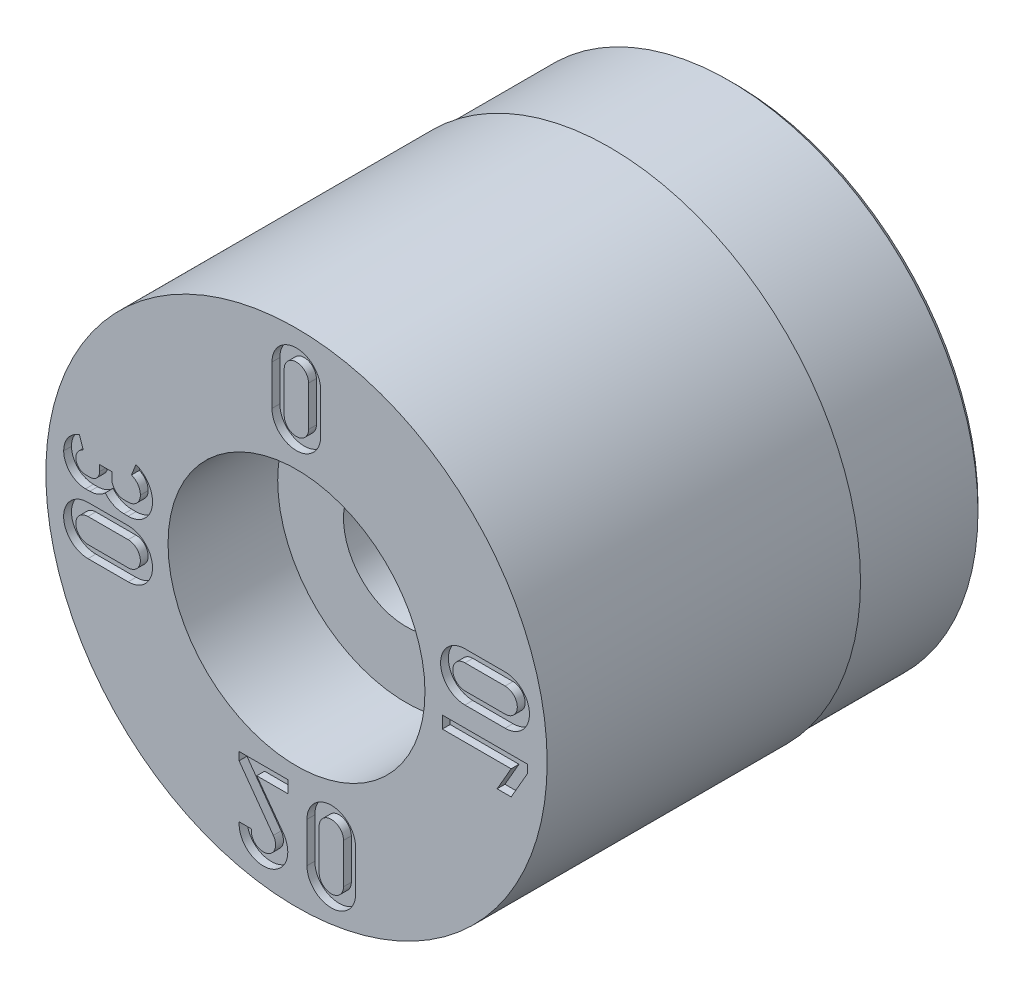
ISO-10303-21;
HEADER;
FILE_DESCRIPTION(('STEP AP214'),'2;1');
FILE_NAME('part.step','',(''),(''),'','','');
FILE_SCHEMA(('AUTOMOTIVE_DESIGN { 1 0 10303 214 1 1 1 1 }'));
ENDSEC;
DATA;
#1=APPLICATION_CONTEXT('core data for automotive mechanical design processes');
#2=APPLICATION_PROTOCOL_DEFINITION('international standard','automotive_design',2000,#1);
#3=PRODUCT_CONTEXT('',#1,'mechanical');
#4=PRODUCT('Part','Part','',(#3));
#5=PRODUCT_RELATED_PRODUCT_CATEGORY('part','',(#4));
#6=PRODUCT_DEFINITION_FORMATION('','',#4);
#7=PRODUCT_DEFINITION_CONTEXT('part definition',#1,'design');
#8=PRODUCT_DEFINITION('design','',#6,#7);
#9=PRODUCT_DEFINITION_SHAPE('','',#8);
#10=(LENGTH_UNIT() NAMED_UNIT(*) SI_UNIT(.MILLI.,.METRE.));
#11=(NAMED_UNIT(*) PLANE_ANGLE_UNIT() SI_UNIT($,.RADIAN.));
#12=(NAMED_UNIT(*) SI_UNIT($,.STERADIAN.) SOLID_ANGLE_UNIT());
#13=UNCERTAINTY_MEASURE_WITH_UNIT(LENGTH_MEASURE(1.E-05),#10,'distance_accuracy_value','');
#14=(GEOMETRIC_REPRESENTATION_CONTEXT(3) GLOBAL_UNCERTAINTY_ASSIGNED_CONTEXT((#13)) GLOBAL_UNIT_ASSIGNED_CONTEXT((#10,
#11,#12)) REPRESENTATION_CONTEXT('',''));
#15=CARTESIAN_POINT('',(0.,0.,0.));
#16=DIRECTION('',(0.,0.,1.));
#17=DIRECTION('',(1.,0.,0.));
#18=AXIS2_PLACEMENT_3D('',#15,#16,#17);
#19=CARTESIAN_POINT('',(0.,0.,3.79790950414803));
#20=DIRECTION('',(0.,0.,1.));
#21=DIRECTION('',(1.,0.,0.));
#22=AXIS2_PLACEMENT_3D('',#19,#20,#21);
#23=CYLINDRICAL_SURFACE('',#22,8.);
#24=CARTESIAN_POINT('',(0.,0.,0.));
#25=DIRECTION('',(0.,0.,1.));
#26=DIRECTION('',(1.,0.,0.));
#27=AXIS2_PLACEMENT_3D('',#24,#25,#26);
#28=CIRCLE('',#27,8.);
#29=CARTESIAN_POINT('',(8.,0.,0.));
#30=VERTEX_POINT('',#29);
#31=EDGE_CURVE('E11',#30,#30,#28,.T.);
#32=ORIENTED_EDGE('',*,*,#31,.F.);
#33=EDGE_LOOP('',(#32));
#34=FACE_BOUND('',#33,.T.);
#35=CARTESIAN_POINT('',(0.,0.,-10.));
#36=DIRECTION('',(0.,0.,-1.));
#37=DIRECTION('',(-1.,0.,0.));
#38=AXIS2_PLACEMENT_3D('',#35,#36,#37);
#39=CIRCLE('',#38,8.);
#40=CARTESIAN_POINT('',(-8.,0.,-10.));
#41=VERTEX_POINT('',#40);
#42=EDGE_CURVE('E37',#41,#41,#39,.T.);
#43=ORIENTED_EDGE('',*,*,#42,.F.);
#44=EDGE_LOOP('',(#43));
#45=FACE_BOUND('',#44,.T.);
#46=ADVANCED_FACE('F34',(#34,#45),#23,.T.);
#47=CARTESIAN_POINT('',(0.,0.,-14.));
#48=DIRECTION('',(0.,0.,1.));
#49=DIRECTION('',(1.,0.,0.));
#50=AXIS2_PLACEMENT_3D('',#47,#48,#49);
#51=CONICAL_SURFACE('',#50,7.7499999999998,0.785398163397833);
#52=CARTESIAN_POINT('',(0.,0.,-14.));
#53=DIRECTION('',(0.,0.,1.));
#54=DIRECTION('',(1.,0.,0.));
#55=AXIS2_PLACEMENT_3D('',#52,#53,#54);
#56=CIRCLE('',#55,7.7499999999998);
#57=CARTESIAN_POINT('',(7.7499999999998,0.,-14.));
#58=VERTEX_POINT('',#57);
#59=EDGE_CURVE('E1032',#58,#58,#56,.T.);
#60=ORIENTED_EDGE('',*,*,#59,.T.);
#61=EDGE_LOOP('',(#60));
#62=FACE_BOUND('',#61,.T.);
#63=CARTESIAN_POINT('',(0.,0.,-13.8149999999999));
#64=DIRECTION('',(0.,0.,1.));
#65=DIRECTION('',(1.,0.,0.));
#66=AXIS2_PLACEMENT_3D('',#63,#64,#65);
#67=CIRCLE('',#66,7.935);
#68=CARTESIAN_POINT('',(7.935,0.,-13.8149999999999));
#69=VERTEX_POINT('',#68);
#70=EDGE_CURVE('E1031',#69,#69,#67,.T.);
#71=ORIENTED_EDGE('',*,*,#70,.F.);
#72=EDGE_LOOP('',(#71));
#73=FACE_BOUND('',#72,.T.);
#74=ADVANCED_FACE('F1054',(#62,#73),#51,.T.);
#75=CARTESIAN_POINT('',(0.,8.,0.));
#76=DIRECTION('',(0.,0.,-1.));
#77=DIRECTION('',(-1.,0.,0.));
#78=AXIS2_PLACEMENT_3D('',#75,#76,#77);
#79=PLANE('',#78);
#80=DIRECTION('',(0.999999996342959,-8.55224061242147E-05,0.));
#81=VECTOR('',#80,1.);
#82=CARTESIAN_POINT('',(-5.37267746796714,-1.69562570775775,0.));
#83=LINE('',#82,#81);
#84=CARTESIAN_POINT('',(-6.65496143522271,-1.69551604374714,0.));
#85=VERTEX_POINT('',#84);
#86=CARTESIAN_POINT('',(-5.37267746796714,-1.69562570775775,0.));
#87=VERTEX_POINT('',#86);
#88=EDGE_CURVE('E522',#85,#87,#83,.T.);
#89=ORIENTED_EDGE('',*,*,#88,.F.);
#90=CARTESIAN_POINT('',(-6.65489496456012,-0.918273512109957,0.));
#91=DIRECTION('',(0.,0.,1.));
#92=DIRECTION('',(1.,0.,0.));
#93=AXIS2_PLACEMENT_3D('',#90,#91,#92);
#94=CIRCLE('',#93,0.777242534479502);
#95=CARTESIAN_POINT('',(-6.65482849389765,-0.141030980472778,0.));
#96=VERTEX_POINT('',#95);
#97=EDGE_CURVE('E50',#96,#85,#94,.T.);
#98=ORIENTED_EDGE('',*,*,#97,.F.);
#99=DIRECTION('',(-0.999999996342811,8.5524132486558E-05,0.));
#100=VECTOR('',#99,1.);
#101=CARTESIAN_POINT('',(-6.65482849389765,-0.141030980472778,0.));
#102=LINE('',#101,#100);
#103=CARTESIAN_POINT('',(-5.37258386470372,-0.141140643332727,0.));
#104=VERTEX_POINT('',#103);
#105=EDGE_CURVE('E511',#104,#96,#102,.T.);
#106=ORIENTED_EDGE('',*,*,#105,.F.);
#107=CARTESIAN_POINT('',(-5.37262673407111,-0.91838317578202,0.));
#108=DIRECTION('',(0.,0.,1.));
#109=DIRECTION('',(1.,0.,0.));
#110=AXIS2_PLACEMENT_3D('',#107,#108,#109);
#111=CIRCLE('',#110,0.777242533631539);
#112=EDGE_CURVE('E525',#87,#104,#111,.T.);
#113=ORIENTED_EDGE('',*,*,#112,.F.);
#114=EDGE_LOOP('',(#89,#98,#106,#113));
#115=FACE_BOUND('',#114,.T.);
#116=DIRECTION('',(8.43544746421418E-05,-0.999999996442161,0.));
#117=VECTOR('',#116,1.);
#118=CARTESIAN_POINT('',(-0.781861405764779,6.67559749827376,0.));
#119=LINE('',#118,#117);
#120=CARTESIAN_POINT('',(-0.781861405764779,6.67559749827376,0.));
#121=VERTEX_POINT('',#120);
#122=CARTESIAN_POINT('',(-0.781753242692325,5.39335286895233,0.));
#123=VERTEX_POINT('',#122);
#124=EDGE_CURVE('E586',#121,#123,#119,.T.);
#125=ORIENTED_EDGE('',*,*,#124,.F.);
#126=CARTESIAN_POINT('',(-0.00451008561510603,6.67566306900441,0.));
#127=DIRECTION('',(0.,0.,1.));
#128=DIRECTION('',(1.,0.,0.));
#129=AXIS2_PLACEMENT_3D('',#126,#127,#128);
#130=CIRCLE('',#129,0.777351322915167);
#131=CARTESIAN_POINT('',(0.772841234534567,6.67572863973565,0.));
#132=VERTEX_POINT('',#131);
#133=EDGE_CURVE('E564',#132,#121,#130,.T.);
#134=ORIENTED_EDGE('',*,*,#133,.F.);
#135=DIRECTION('',(8.53287261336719E-05,0.999999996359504,0.));
#136=VECTOR('',#135,1.);
#137=CARTESIAN_POINT('',(0.772731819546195,5.39345251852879,0.));
#138=LINE('',#137,#136);
#139=CARTESIAN_POINT('',(0.772731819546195,5.39345251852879,0.));
#140=VERTEX_POINT('',#139);
#141=EDGE_CURVE('E575',#140,#132,#138,.T.);
#142=ORIENTED_EDGE('',*,*,#141,.F.);
#143=CARTESIAN_POINT('',(-0.00451071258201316,5.39341843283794,0.));
#144=DIRECTION('',(0.,0.,1.));
#145=DIRECTION('',(1.,0.,0.));
#146=AXIS2_PLACEMENT_3D('',#143,#144,#145);
#147=CIRCLE('',#146,0.777242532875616);
#148=EDGE_CURVE('E589',#123,#140,#147,.T.);
#149=ORIENTED_EDGE('',*,*,#148,.F.);
#150=EDGE_LOOP('',(#125,#134,#142,#149));
#151=FACE_BOUND('',#150,.T.);
#152=DIRECTION('',(-8.43514763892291E-05,0.999999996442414,0.));
#153=VECTOR('',#152,1.);
#154=CARTESIAN_POINT('',(-0.278135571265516,-5.00273873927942,0.));
#155=LINE('',#154,#153);
#156=CARTESIAN_POINT('',(-0.278135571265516,-5.00273873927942,0.));
#157=VERTEX_POINT('',#156);
#158=CARTESIAN_POINT('',(-0.278168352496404,-4.61411210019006,0.));
#159=VERTEX_POINT('',#158);
#160=EDGE_CURVE('E633',#157,#159,#155,.T.);
#161=ORIENTED_EDGE('',*,*,#160,.F.);
#162=DIRECTION('',(0.999999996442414,8.43514759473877E-05,0.));
#163=VECTOR('',#162,1.);
#164=CARTESIAN_POINT('',(-1.26905452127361,-5.0028223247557,0.));
#165=LINE('',#164,#163);
#166=CARTESIAN_POINT('',(-1.26905452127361,-5.0028223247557,0.));
#167=VERTEX_POINT('',#166);
#168=EDGE_CURVE('E596',#167,#157,#165,.T.);
#169=ORIENTED_EDGE('',*,*,#168,.F.);
#170=DIRECTION('',(-0.589622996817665,0.80767860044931,0.));
#171=VECTOR('',#170,1.);
#172=CARTESIAN_POINT('',(-0.423857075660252,-6.16059244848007,0.));
#173=LINE('',#172,#171);
#174=CARTESIAN_POINT('',(-0.423857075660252,-6.16059244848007,0.));
#175=VERTEX_POINT('',#174);
#176=EDGE_CURVE('E607',#175,#167,#173,.T.);
#177=ORIENTED_EDGE('',*,*,#176,.F.);
#178=CARTESIAN_POINT('',(-1.05480031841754,-6.61483793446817,0.));
#179=DIRECTION('',(0.,0.,1.));
#180=DIRECTION('',(1.,0.,0.));
#181=AXIS2_PLACEMENT_3D('',#178,#179,#180);
#182=CIRCLE('',#181,0.777449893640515);
#183=CARTESIAN_POINT('',(-1.83009752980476,-6.55702296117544,0.));
#184=VERTEX_POINT('',#183);
#185=EDGE_CURVE('E651',#184,#175,#182,.T.);
#186=ORIENTED_EDGE('',*,*,#185,.F.);
#187=DIRECTION('',(-0.999999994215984,-0.000107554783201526,0.));
#188=VECTOR('',#187,1.);
#189=CARTESIAN_POINT('',(-1.43926715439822,-6.5569809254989,0.));
#190=LINE('',#189,#188);
#191=CARTESIAN_POINT('',(-1.43926715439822,-6.5569809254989,0.));
#192=VERTEX_POINT('',#191);
#193=EDGE_CURVE('E648',#192,#184,#190,.T.);
#194=ORIENTED_EDGE('',*,*,#193,.F.);
#195=CARTESIAN_POINT('',(-1.05499673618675,-6.61526449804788,0.));
#196=DIRECTION('',(0.,0.,-1.));
#197=DIRECTION('',(1.,0.,0.));
#198=AXIS2_PLACEMENT_3D('',#195,#196,#197);
#199=CIRCLE('',#198,0.388665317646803);
#200=CARTESIAN_POINT('',(-0.739643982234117,-6.38807873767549,0.));
#201=VERTEX_POINT('',#200);
#202=EDGE_CURVE('E645',#201,#192,#199,.T.);
#203=ORIENTED_EDGE('',*,*,#202,.F.);
#204=DIRECTION('',(0.584527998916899,-0.811373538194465,0.));
#205=VECTOR('',#204,1.);
#206=CARTESIAN_POINT('',(-1.83241566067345,-4.87122064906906,0.));
#207=LINE('',#206,#205);
#208=CARTESIAN_POINT('',(-1.83241566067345,-4.87122064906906,0.));
#209=VERTEX_POINT('',#208);
#210=EDGE_CURVE('E642',#209,#201,#207,.T.);
#211=ORIENTED_EDGE('',*,*,#210,.F.);
#212=DIRECTION('',(8.43514743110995E-05,-0.999999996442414,0.));
#213=VECTOR('',#212,1.);
#214=CARTESIAN_POINT('',(-1.83243733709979,-4.61424320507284,0.));
#215=LINE('',#214,#213);
#216=CARTESIAN_POINT('',(-1.83243733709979,-4.61424320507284,0.));
#217=VERTEX_POINT('',#216);
#218=EDGE_CURVE('E639',#217,#209,#215,.T.);
#219=ORIENTED_EDGE('',*,*,#218,.F.);
#220=DIRECTION('',(-0.999999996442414,-8.43514755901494E-05,0.));
#221=VECTOR('',#220,1.);
#222=CARTESIAN_POINT('',(-0.278168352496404,-4.61411210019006,0.));
#223=LINE('',#222,#221);
#224=EDGE_CURVE('E636',#159,#217,#223,.T.);
#225=ORIENTED_EDGE('',*,*,#224,.F.);
#226=EDGE_LOOP('',(#161,#169,#177,#186,#194,#203,#211,#219,#225));
#227=FACE_BOUND('',#226,.T.);
#228=DIRECTION('',(8.48997848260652E-05,-0.999999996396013,0.));
#229=VECTOR('',#228,1.);
#230=CARTESIAN_POINT('',(4.65445946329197,-0.75130425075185,0.));
#231=LINE('',#230,#229);
#232=CARTESIAN_POINT('',(4.65442647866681,-0.362791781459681,0.));
#233=VERTEX_POINT('',#232);
#234=CARTESIAN_POINT('',(4.65445946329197,-0.75130425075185,0.));
#235=VERTEX_POINT('',#234);
#236=EDGE_CURVE('E699',#233,#235,#231,.T.);
#237=ORIENTED_EDGE('',*,*,#236,.F.);
#238=DIRECTION('',(-0.999999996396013,-8.4899784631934E-05,0.));
#239=VECTOR('',#238,1.);
#240=CARTESIAN_POINT('',(4.65442647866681,-0.362791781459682,0.));
#241=LINE('',#240,#239);
#242=CARTESIAN_POINT('',(7.37434015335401,-0.362560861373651,0.));
#243=VERTEX_POINT('',#242);
#244=EDGE_CURVE('E658',#243,#233,#241,.T.);
#245=ORIENTED_EDGE('',*,*,#244,.F.);
#246=DIRECTION('',(-8.48997827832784E-05,0.999999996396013,0.));
#247=VECTOR('',#246,1.);
#248=CARTESIAN_POINT('',(7.37434015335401,-0.362560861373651,0.));
#249=LINE('',#248,#247);
#250=CARTESIAN_POINT('',(7.37436186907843,-0.618341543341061,0.));
#251=VERTEX_POINT('',#250);
#252=EDGE_CURVE('E679',#251,#243,#249,.T.);
#253=ORIENTED_EDGE('',*,*,#252,.F.);
#254=DIRECTION('',(0.498418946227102,0.866936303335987,0.));
#255=VECTOR('',#254,1.);
#256=CARTESIAN_POINT('',(7.37436186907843,-0.618341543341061,0.));
#257=LINE('',#256,#255);
#258=CARTESIAN_POINT('',(6.85123652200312,-1.52825148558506,0.));
#259=VERTEX_POINT('',#258);
#260=EDGE_CURVE('E711',#259,#251,#257,.T.);
#261=ORIENTED_EDGE('',*,*,#260,.F.);
#262=DIRECTION('',(0.999999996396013,8.48997839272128E-05,0.));
#263=VECTOR('',#262,1.);
#264=CARTESIAN_POINT('',(6.85123652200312,-1.52825148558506,0.));
#265=LINE('',#264,#263);
#266=CARTESIAN_POINT('',(6.40310354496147,-1.52828953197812,0.));
#267=VERTEX_POINT('',#266);
#268=EDGE_CURVE('E708',#267,#259,#265,.T.);
#269=ORIENTED_EDGE('',*,*,#268,.F.);
#270=DIRECTION('',(-0.498285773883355,-0.867012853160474,0.));
#271=VECTOR('',#270,1.);
#272=CARTESIAN_POINT('',(6.40310354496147,-1.52828953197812,0.));
#273=LINE('',#272,#271);
#274=CARTESIAN_POINT('',(6.84975618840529,-0.751117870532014,0.));
#275=VERTEX_POINT('',#274);
#276=EDGE_CURVE('E705',#275,#267,#273,.T.);
#277=ORIENTED_EDGE('',*,*,#276,.F.);
#278=DIRECTION('',(0.999999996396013,8.48997846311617E-05,0.));
#279=VECTOR('',#278,1.);
#280=CARTESIAN_POINT('',(6.84975618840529,-0.751117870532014,0.));
#281=LINE('',#280,#279);
#282=EDGE_CURVE('E702',#235,#275,#281,.T.);
#283=ORIENTED_EDGE('',*,*,#282,.F.);
#284=EDGE_LOOP('',(#237,#245,#253,#261,#269,#277,#283));
#285=FACE_BOUND('',#284,.T.);
#286=DIRECTION('',(-0.999999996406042,8.47815831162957E-05,0.));
#287=VECTOR('',#286,1.);
#288=CARTESIAN_POINT('',(6.65807339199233,1.82856574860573,0.));
#289=LINE('',#288,#287);
#290=CARTESIAN_POINT('',(6.65807339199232,1.82856574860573,0.));
#291=VERTEX_POINT('',#290);
#292=CARTESIAN_POINT('',(5.37582874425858,1.8286744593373,0.));
#293=VERTEX_POINT('',#292);
#294=EDGE_CURVE('E779',#291,#293,#289,.T.);
#295=ORIENTED_EDGE('',*,*,#294,.F.);
#296=CARTESIAN_POINT('',(6.6581393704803,1.0514320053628,0.));
#297=DIRECTION('',(0.,0.,1.));
#298=DIRECTION('',(1.,0.,0.));
#299=AXIS2_PLACEMENT_3D('',#296,#297,#298);
#300=CIRCLE('',#299,0.777133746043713);
#301=CARTESIAN_POINT('',(6.65820534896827,0.274298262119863,0.));
#302=VERTEX_POINT('',#301);
#303=EDGE_CURVE('E757',#302,#291,#300,.T.);
#304=ORIENTED_EDGE('',*,*,#303,.F.);
#305=DIRECTION('',(0.999999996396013,8.48997850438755E-05,0.));
#306=VECTOR('',#305,1.);
#307=CARTESIAN_POINT('',(5.37592924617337,0.274189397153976,0.));
#308=LINE('',#307,#306);
#309=CARTESIAN_POINT('',(5.37592924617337,0.274189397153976,0.));
#310=VERTEX_POINT('',#309);
#311=EDGE_CURVE('E768',#310,#302,#308,.T.);
#312=ORIENTED_EDGE('',*,*,#311,.F.);
#313=CARTESIAN_POINT('',(5.37589473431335,1.05143192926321,0.));
#314=DIRECTION('',(0.,0.,1.));
#315=DIRECTION('',(1.,0.,0.));
#316=AXIS2_PLACEMENT_3D('',#313,#314,#315);
#317=CIRCLE('',#316,0.777242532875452);
#318=EDGE_CURVE('E782',#293,#310,#317,.T.);
#319=ORIENTED_EDGE('',*,*,#318,.F.);
#320=EDGE_LOOP('',(#295,#304,#312,#319));
#321=FACE_BOUND('',#320,.T.);
#322=DIRECTION('',(-0.999999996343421,8.55170029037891E-05,0.));
#323=VECTOR('',#322,1.);
#324=CARTESIAN_POINT('',(-5.3716432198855,0.506985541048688,0.));
#325=LINE('',#324,#323);
#326=CARTESIAN_POINT('',(-5.3716432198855,0.506985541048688,0.));
#327=VERTEX_POINT('',#326);
#328=CARTESIAN_POINT('',(-5.50764232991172,0.506997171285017,0.));
#329=VERTEX_POINT('',#328);
#330=EDGE_CURVE('E862',#327,#329,#325,.T.);
#331=ORIENTED_EDGE('',*,*,#330,.F.);
#332=CARTESIAN_POINT('',(-5.37160999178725,0.895541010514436,0.));
#333=DIRECTION('',(0.,0.,-1.));
#334=DIRECTION('',(1.,0.,0.));
#335=AXIS2_PLACEMENT_3D('',#332,#333,#334);
#336=CIRCLE('',#335,0.388555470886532);
#337=CARTESIAN_POINT('',(-4.98305452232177,0.895507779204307,0.));
#338=VERTEX_POINT('',#337);
#339=EDGE_CURVE('E789',#338,#327,#336,.T.);
#340=ORIENTED_EDGE('',*,*,#339,.F.);
#341=CARTESIAN_POINT('',(-5.42998520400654,0.895546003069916,0.));
#342=DIRECTION('',(0.,0.,-1.));
#343=DIRECTION('',(1.,0.,0.));
#344=AXIS2_PLACEMENT_3D('',#341,#342,#343);
#345=CIRCLE('',#344,0.446930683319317);
#346=CARTESIAN_POINT('',(-5.26591138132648,1.31127045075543,0.));
#347=VERTEX_POINT('',#346);
#348=EDGE_CURVE('E800',#347,#338,#345,.T.);
#349=ORIENTED_EDGE('',*,*,#348,.F.);
#350=DIRECTION('',(-0.367087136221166,-0.930186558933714,0.));
#351=VECTOR('',#350,1.);
#352=CARTESIAN_POINT('',(-5.12331156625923,1.672613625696,0.));
#353=LINE('',#352,#351);
#354=CARTESIAN_POINT('',(-5.12331156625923,1.672613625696,0.));
#355=VERTEX_POINT('',#354);
#356=EDGE_CURVE('E916',#355,#347,#353,.T.);
#357=ORIENTED_EDGE('',*,*,#356,.F.);
#358=CARTESIAN_POINT('',(-5.4301756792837,0.89536347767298,0.));
#359=DIRECTION('',(0.,0.,1.));
#360=DIRECTION('',(1.,0.,0.));
#361=AXIS2_PLACEMENT_3D('',#358,#359,#360);
#362=CIRCLE('',#361,0.835633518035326);
#363=CARTESIAN_POINT('',(-4.59454216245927,0.895408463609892,0.));
#364=VERTEX_POINT('',#363);
#365=EDGE_CURVE('E913',#364,#355,#362,.T.);
#366=ORIENTED_EDGE('',*,*,#365,.F.);
#367=CARTESIAN_POINT('',(-5.37154447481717,0.89536663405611,0.));
#368=DIRECTION('',(0.,0.,1.));
#369=DIRECTION('',(1.,0.,0.));
#370=AXIS2_PLACEMENT_3D('',#367,#368,#369);
#371=CIRCLE('',#370,0.777002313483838);
#372=CARTESIAN_POINT('',(-5.37161071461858,0.118364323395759,0.));
#373=VERTEX_POINT('',#372);
#374=EDGE_CURVE('E910',#373,#364,#371,.T.);
#375=ORIENTED_EDGE('',*,*,#374,.F.);
#376=DIRECTION('',(0.99999999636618,-8.52504561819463E-05,0.));
#377=VECTOR('',#376,1.);
#378=CARTESIAN_POINT('',(-5.50765962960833,0.118375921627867,0.));
#379=LINE('',#378,#377);
#380=CARTESIAN_POINT('',(-5.50765962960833,0.118375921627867,0.));
#381=VERTEX_POINT('',#380);
#382=EDGE_CURVE('E907',#381,#373,#379,.T.);
#383=ORIENTED_EDGE('',*,*,#382,.F.);
#384=CARTESIAN_POINT('',(-5.5077802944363,0.895183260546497,0.));
#385=DIRECTION('',(0.,0.,1.));
#386=DIRECTION('',(1.,0.,0.));
#387=AXIS2_PLACEMENT_3D('',#384,#385,#386);
#388=CIRCLE('',#387,0.776807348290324);
#389=CARTESIAN_POINT('',(-6.10439934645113,0.397714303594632,0.));
#390=VERTEX_POINT('',#389);
#391=EDGE_CURVE('E904',#390,#381,#388,.T.);
#392=ORIENTED_EDGE('',*,*,#391,.F.);
#393=CARTESIAN_POINT('',(-6.5955278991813,0.895269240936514,0.));
#394=DIRECTION('',(0.,0.,1.));
#395=DIRECTION('',(1.,0.,0.));
#396=AXIS2_PLACEMENT_3D('',#393,#394,#395);
#397=CIRCLE('',#396,0.699119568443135);
#398=CARTESIAN_POINT('',(-6.59558796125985,0.196149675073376,0.));
#399=VERTEX_POINT('',#398);
#400=EDGE_CURVE('E901',#399,#390,#397,.T.);
#401=ORIENTED_EDGE('',*,*,#400,.F.);
#402=DIRECTION('',(0.999999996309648,-8.59110265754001E-05,0.));
#403=VECTOR('',#402,1.);
#404=CARTESIAN_POINT('',(-6.73152961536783,0.196161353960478,0.));
#405=LINE('',#404,#403);
#406=CARTESIAN_POINT('',(-6.73152961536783,0.196161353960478,0.));
#407=VERTEX_POINT('',#406);
#408=EDGE_CURVE('E898',#407,#399,#405,.T.);
#409=ORIENTED_EDGE('',*,*,#408,.F.);
#410=CARTESIAN_POINT('',(-6.7315778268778,0.895514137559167,0.));
#411=DIRECTION('',(0.,0.,1.));
#412=DIRECTION('',(1.,0.,0.));
#413=AXIS2_PLACEMENT_3D('',#410,#411,#412);
#414=CIRCLE('',#413,0.699352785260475);
#415=CARTESIAN_POINT('',(-7.43093057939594,0.895728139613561,0.));
#416=VERTEX_POINT('',#415);
#417=EDGE_CURVE('E895',#416,#407,#414,.T.);
#418=ORIENTED_EDGE('',*,*,#417,.F.);
#419=CARTESIAN_POINT('',(-6.69246587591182,0.895502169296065,0.));
#420=DIRECTION('',(0.,0.,1.));
#421=DIRECTION('',(1.,0.,0.));
#422=AXIS2_PLACEMENT_3D('',#419,#420,#421);
#423=CIRCLE('',#422,0.738464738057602);
#424=CARTESIAN_POINT('',(-6.92892974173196,1.59508419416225,0.));
#425=VERTEX_POINT('',#424);
#426=EDGE_CURVE('E892',#425,#416,#423,.T.);
#427=ORIENTED_EDGE('',*,*,#426,.F.);
#428=DIRECTION('',(-0.31992398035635,0.947443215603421,0.));
#429=VECTOR('',#428,1.);
#430=CARTESIAN_POINT('',(-6.80460514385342,1.2269014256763,0.));
#431=LINE('',#430,#429);
#432=CARTESIAN_POINT('',(-6.80460514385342,1.2269014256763,0.));
#433=VERTEX_POINT('',#432);
#434=EDGE_CURVE('E889',#433,#425,#431,.T.);
#435=ORIENTED_EDGE('',*,*,#434,.F.);
#436=CARTESIAN_POINT('',(-6.6931186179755,0.895937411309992,0.));
#437=DIRECTION('',(0.,0.,-1.));
#438=DIRECTION('',(1.,0.,0.));
#439=AXIS2_PLACEMENT_3D('',#436,#437,#438);
#440=CIRCLE('',#439,0.349236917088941);
#441=CARTESIAN_POINT('',(-7.04235540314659,0.895633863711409,0.));
#442=VERTEX_POINT('',#441);
#443=EDGE_CURVE('E886',#442,#433,#440,.T.);
#444=ORIENTED_EDGE('',*,*,#443,.F.);
#445=CARTESIAN_POINT('',(-6.73123368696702,0.895904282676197,0.));
#446=DIRECTION('',(0.,0.,-1.));
#447=DIRECTION('',(1.,0.,0.));
#448=AXIS2_PLACEMENT_3D('',#445,#446,#447);
#449=CIRCLE('',#448,0.311121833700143);
#450=CARTESIAN_POINT('',(-6.73153501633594,0.584782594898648,0.));
#451=VERTEX_POINT('',#450);
#452=EDGE_CURVE('E883',#451,#442,#449,.T.);
#453=ORIENTED_EDGE('',*,*,#452,.F.);
#454=DIRECTION('',(-0.999999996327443,8.57036442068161E-05,0.));
#455=VECTOR('',#454,1.);
#456=CARTESIAN_POINT('',(-6.59555472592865,0.584770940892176,0.));
#457=LINE('',#456,#455);
#458=CARTESIAN_POINT('',(-6.59555472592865,0.584770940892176,0.));
#459=VERTEX_POINT('',#458);
#460=EDGE_CURVE('E880',#459,#451,#457,.T.);
#461=ORIENTED_EDGE('',*,*,#460,.F.);
#462=CARTESIAN_POINT('',(-6.59552808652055,0.895602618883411,0.));
#463=DIRECTION('',(0.,0.,-1.));
#464=DIRECTION('',(1.,0.,0.));
#465=AXIS2_PLACEMENT_3D('',#462,#463,#464);
#466=CIRCLE('',#465,0.310831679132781);
#467=CARTESIAN_POINT('',(-6.28469640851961,0.895576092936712,0.));
#468=VERTEX_POINT('',#467);
#469=EDGE_CURVE('E877',#468,#459,#466,.T.);
#470=ORIENTED_EDGE('',*,*,#469,.F.);
#471=DIRECTION('',(-8.55211336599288E-05,-0.999999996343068,0.));
#472=VECTOR('',#471,1.);
#473=CARTESIAN_POINT('',(-6.28467980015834,1.08977792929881,0.));
#474=LINE('',#473,#472);
#475=CARTESIAN_POINT('',(-6.28467980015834,1.08977792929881,0.));
#476=VERTEX_POINT('',#475);
#477=EDGE_CURVE('E874',#476,#468,#474,.T.);
#478=ORIENTED_EDGE('',*,*,#477,.F.);
#479=DIRECTION('',(-0.999999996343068,8.55211334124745E-05,0.));
#480=VECTOR('',#479,1.);
#481=CARTESIAN_POINT('',(-5.89605853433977,1.08974469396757,0.));
#482=LINE('',#481,#480);
#483=CARTESIAN_POINT('',(-5.89605853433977,1.08974469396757,0.));
#484=VERTEX_POINT('',#483);
#485=EDGE_CURVE('E871',#484,#476,#482,.T.);
#486=ORIENTED_EDGE('',*,*,#485,.F.);
#487=DIRECTION('',(8.54959125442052E-05,0.999999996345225,0.));
#488=VECTOR('',#487,1.);
#489=CARTESIAN_POINT('',(-5.89607514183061,0.895495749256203,0.));
#490=LINE('',#489,#488);
#491=CARTESIAN_POINT('',(-5.89607514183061,0.895495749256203,0.));
#492=VERTEX_POINT('',#491);
#493=EDGE_CURVE('E868',#492,#484,#490,.T.);
#494=ORIENTED_EDGE('',*,*,#493,.F.);
#495=CARTESIAN_POINT('',(-5.50760977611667,0.895462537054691,0.));
#496=DIRECTION('',(0.,0.,-1.));
#497=DIRECTION('',(1.,0.,0.));
#498=AXIS2_PLACEMENT_3D('',#495,#496,#497);
#499=CIRCLE('',#498,0.388465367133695);
#500=EDGE_CURVE('E865',#329,#492,#499,.T.);
#501=ORIENTED_EDGE('',*,*,#500,.F.);
#502=EDGE_LOOP('',(#331,#340,#349,#357,#366,#375,#383,#392,#401,#409,#418,#427,#435,#444,#453,
#461,#470,#478,#486,#494,#501));
#503=FACE_BOUND('',#502,.T.);
#504=DIRECTION('',(8.53270660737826E-05,0.999999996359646,0.));
#505=VECTOR('',#504,1.);
#506=CARTESIAN_POINT('',(1.88801316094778,-6.6887471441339,0.));
#507=LINE('',#506,#505);
#508=CARTESIAN_POINT('',(1.88801316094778,-6.6887471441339,0.));
#509=VERTEX_POINT('',#508);
#510=CARTESIAN_POINT('',(1.88812256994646,-5.40651627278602,0.));
#511=VERTEX_POINT('',#510);
#512=EDGE_CURVE('E1012',#509,#511,#507,.T.);
#513=ORIENTED_EDGE('',*,*,#512,.F.);
#514=CARTESIAN_POINT('',(1.11077062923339,-6.68881270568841,0.));
#515=DIRECTION('',(0.,0.,1.));
#516=DIRECTION('',(1.,0.,0.));
#517=AXIS2_PLACEMENT_3D('',#514,#515,#516);
#518=CIRCLE('',#517,0.777242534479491);
#519=CARTESIAN_POINT('',(0.333528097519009,-6.68887826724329,0.));
#520=VERTEX_POINT('',#519);
#521=EDGE_CURVE('E990',#520,#509,#518,.T.);
#522=ORIENTED_EDGE('',*,*,#521,.F.);
#523=DIRECTION('',(8.4351475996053E-05,-0.999999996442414,0.));
#524=VECTOR('',#523,1.);
#525=CARTESIAN_POINT('',(0.333419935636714,-5.40660216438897,0.));
#526=LINE('',#525,#524);
#527=CARTESIAN_POINT('',(0.333419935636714,-5.40660216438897,0.));
#528=VERTEX_POINT('',#527);
#529=EDGE_CURVE('E1001',#528,#520,#526,.T.);
#530=ORIENTED_EDGE('',*,*,#529,.F.);
#531=CARTESIAN_POINT('',(1.11077125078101,-5.40652282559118,0.));
#532=DIRECTION('',(0.,0.,1.));
#533=DIRECTION('',(1.,0.,0.));
#534=AXIS2_PLACEMENT_3D('',#531,#532,#533);
#535=CIRCLE('',#534,0.77735131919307);
#536=EDGE_CURVE('E1015',#511,#528,#535,.T.);
#537=ORIENTED_EDGE('',*,*,#536,.F.);
#538=EDGE_LOOP('',(#513,#522,#530,#537));
#539=FACE_BOUND('',#538,.T.);
#540=CARTESIAN_POINT('',(0.,0.,0.));
#541=DIRECTION('',(0.,0.,1.));
#542=DIRECTION('',(1.,0.,0.));
#543=AXIS2_PLACEMENT_3D('',#540,#541,#542);
#544=CIRCLE('',#543,4.1);
#545=CARTESIAN_POINT('',(4.1,0.,0.));
#546=VERTEX_POINT('',#545);
#547=EDGE_CURVE('E42',#546,#546,#544,.T.);
#548=ORIENTED_EDGE('',*,*,#547,.F.);
#549=EDGE_LOOP('',(#548));
#550=FACE_BOUND('',#549,.T.);
#551=ORIENTED_EDGE('',*,*,#31,.T.);
#552=EDGE_LOOP('',(#551));
#553=FACE_BOUND('',#552,.T.);
#554=ADVANCED_FACE('F1059',(#115,#151,#227,#285,#321,#503,#539,#550,#553),#79,.F.);
#555=CARTESIAN_POINT('',(0.,0.,3.79790950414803));
#556=DIRECTION('',(0.,0.,1.));
#557=DIRECTION('',(1.,0.,0.));
#558=AXIS2_PLACEMENT_3D('',#555,#556,#557);
#559=CYLINDRICAL_SURFACE('',#558,4.1);
#560=CARTESIAN_POINT('',(0.,0.,-3.5));
#561=DIRECTION('',(0.,0.,1.));
#562=DIRECTION('',(1.,0.,0.));
#563=AXIS2_PLACEMENT_3D('',#560,#561,#562);
#564=CIRCLE('',#563,4.1);
#565=CARTESIAN_POINT('',(4.1,0.,-3.5));
#566=VERTEX_POINT('',#565);
#567=EDGE_CURVE('E1041',#566,#566,#564,.T.);
#568=ORIENTED_EDGE('',*,*,#567,.F.);
#569=EDGE_LOOP('',(#568));
#570=FACE_BOUND('',#569,.T.);
#571=ORIENTED_EDGE('',*,*,#547,.T.);
#572=EDGE_LOOP('',(#571));
#573=FACE_BOUND('',#572,.T.);
#574=ADVANCED_FACE('F1065',(#570,#573),#559,.F.);
#575=CARTESIAN_POINT('',(0.,4.1,-3.5));
#576=DIRECTION('',(0.,0.,-1.));
#577=DIRECTION('',(-1.,0.,0.));
#578=AXIS2_PLACEMENT_3D('',#575,#576,#577);
#579=PLANE('',#578);
#580=CARTESIAN_POINT('',(0.,0.,-3.5));
#581=DIRECTION('',(0.,0.,1.));
#582=DIRECTION('',(1.,0.,0.));
#583=AXIS2_PLACEMENT_3D('',#580,#581,#582);
#584=CIRCLE('',#583,2.);
#585=CARTESIAN_POINT('',(2.,0.,-3.5));
#586=VERTEX_POINT('',#585);
#587=EDGE_CURVE('E1038',#586,#586,#584,.T.);
#588=ORIENTED_EDGE('',*,*,#587,.F.);
#589=EDGE_LOOP('',(#588));
#590=FACE_BOUND('',#589,.T.);
#591=ORIENTED_EDGE('',*,*,#567,.T.);
#592=EDGE_LOOP('',(#591));
#593=FACE_BOUND('',#592,.T.);
#594=ADVANCED_FACE('F1072',(#590,#593),#579,.F.);
#595=CARTESIAN_POINT('',(0.,0.,3.79790950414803));
#596=DIRECTION('',(0.,0.,1.));
#597=DIRECTION('',(1.,0.,0.));
#598=AXIS2_PLACEMENT_3D('',#595,#596,#597);
#599=CYLINDRICAL_SURFACE('',#598,2.);
#600=CARTESIAN_POINT('',(0.,0.,-14.));
#601=DIRECTION('',(0.,0.,1.));
#602=DIRECTION('',(1.,0.,0.));
#603=AXIS2_PLACEMENT_3D('',#600,#601,#602);
#604=CIRCLE('',#603,2.);
#605=CARTESIAN_POINT('',(2.,0.,-14.));
#606=VERTEX_POINT('',#605);
#607=EDGE_CURVE('E1035',#606,#606,#604,.T.);
#608=ORIENTED_EDGE('',*,*,#607,.F.);
#609=EDGE_LOOP('',(#608));
#610=FACE_BOUND('',#609,.T.);
#611=ORIENTED_EDGE('',*,*,#587,.T.);
#612=EDGE_LOOP('',(#611));
#613=FACE_BOUND('',#612,.T.);
#614=ADVANCED_FACE('F1223',(#610,#613),#599,.F.);
#615=CARTESIAN_POINT('',(0.,2.,-14.));
#616=DIRECTION('',(0.,0.,1.));
#617=DIRECTION('',(1.,0.,0.));
#618=AXIS2_PLACEMENT_3D('',#615,#616,#617);
#619=PLANE('',#618);
#620=ORIENTED_EDGE('',*,*,#59,.F.);
#621=EDGE_LOOP('',(#620));
#622=FACE_BOUND('',#621,.T.);
#623=ORIENTED_EDGE('',*,*,#607,.T.);
#624=EDGE_LOOP('',(#623));
#625=FACE_BOUND('',#624,.T.);
#626=ADVANCED_FACE('F1218',(#622,#625),#619,.F.);
#627=CARTESIAN_POINT('',(0.,8.935,-10.));
#628=DIRECTION('',(0.,0.,-1.));
#629=DIRECTION('',(-1.,0.,0.));
#630=AXIS2_PLACEMENT_3D('',#627,#628,#629);
#631=PLANE('',#630);
#632=CARTESIAN_POINT('',(0.,0.,-10.));
#633=DIRECTION('',(0.,0.,1.));
#634=DIRECTION('',(1.,0.,0.));
#635=AXIS2_PLACEMENT_3D('',#632,#633,#634);
#636=CIRCLE('',#635,7.935);
#637=CARTESIAN_POINT('',(7.935,0.,-10.));
#638=VERTEX_POINT('',#637);
#639=EDGE_CURVE('E1022',#638,#638,#636,.T.);
#640=ORIENTED_EDGE('',*,*,#639,.T.);
#641=EDGE_LOOP('',(#640));
#642=FACE_BOUND('',#641,.T.);
#643=ORIENTED_EDGE('',*,*,#42,.T.);
#644=EDGE_LOOP('',(#643));
#645=FACE_BOUND('',#644,.T.);
#646=ADVANCED_FACE('F1051',(#642,#645),#631,.T.);
#647=CARTESIAN_POINT('',(0.,0.,0.));
#648=DIRECTION('',(0.,0.,1.));
#649=DIRECTION('',(1.,0.,0.));
#650=AXIS2_PLACEMENT_3D('',#647,#648,#649);
#651=CYLINDRICAL_SURFACE('',#650,7.935);
#652=ORIENTED_EDGE('',*,*,#639,.F.);
#653=EDGE_LOOP('',(#652));
#654=FACE_BOUND('',#653,.T.);
#655=ORIENTED_EDGE('',*,*,#70,.T.);
#656=EDGE_LOOP('',(#655));
#657=FACE_BOUND('',#656,.T.);
#658=ADVANCED_FACE('F1213',(#654,#657),#651,.T.);
#659=CARTESIAN_POINT('',(1.11077062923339,-6.68881270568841,-0.25));
#660=DIRECTION('',(0.,0.,1.));
#661=DIRECTION('',(1.,0.,0.));
#662=AXIS2_PLACEMENT_3D('',#659,#660,#661);
#663=CYLINDRICAL_SURFACE('',#662,0.777242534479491);
#664=ORIENTED_EDGE('',*,*,#521,.T.);
#665=DIRECTION('',(0.,0.,1.));
#666=VECTOR('',#665,1.);
#667=CARTESIAN_POINT('',(1.88801316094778,-6.6887471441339,-0.25));
#668=LINE('',#667,#666);
#669=CARTESIAN_POINT('',(1.88801316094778,-6.6887471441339,-0.25));
#670=VERTEX_POINT('',#669);
#671=EDGE_CURVE('E1010',#670,#509,#668,.T.);
#672=ORIENTED_EDGE('',*,*,#671,.F.);
#673=CARTESIAN_POINT('',(1.11077062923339,-6.68881270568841,-0.25));
#674=DIRECTION('',(0.,0.,1.));
#675=DIRECTION('',(1.,0.,0.));
#676=AXIS2_PLACEMENT_3D('',#673,#674,#675);
#677=CIRCLE('',#676,0.777242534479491);
#678=CARTESIAN_POINT('',(0.333528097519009,-6.68887826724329,-0.25));
#679=VERTEX_POINT('',#678);
#680=EDGE_CURVE('E997',#679,#670,#677,.T.);
#681=ORIENTED_EDGE('',*,*,#680,.F.);
#682=DIRECTION('',(0.,0.,1.));
#683=VECTOR('',#682,1.);
#684=CARTESIAN_POINT('',(0.333528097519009,-6.68887826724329,-0.25));
#685=LINE('',#684,#683);
#686=EDGE_CURVE('E1020',#679,#520,#685,.T.);
#687=ORIENTED_EDGE('',*,*,#686,.T.);
#688=EDGE_LOOP('',(#664,#672,#681,#687));
#689=FACE_BOUND('',#688,.T.);
#690=ADVANCED_FACE('F1185',(#689),#663,.F.);
#691=CARTESIAN_POINT('',(0.333419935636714,-5.40660216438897,-0.25));
#692=DIRECTION('',(-0.999999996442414,-8.4351475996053E-05,0.));
#693=DIRECTION('',(8.4351475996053E-05,-0.999999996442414,0.));
#694=AXIS2_PLACEMENT_3D('',#691,#692,#693);
#695=PLANE('',#694);
#696=ORIENTED_EDGE('',*,*,#529,.T.);
#697=ORIENTED_EDGE('',*,*,#686,.F.);
#698=DIRECTION('',(8.4351475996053E-05,-0.999999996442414,0.));
#699=VECTOR('',#698,1.);
#700=CARTESIAN_POINT('',(0.333419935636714,-5.40660216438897,-0.25));
#701=LINE('',#700,#699);
#702=CARTESIAN_POINT('',(0.333419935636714,-5.40660216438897,-0.25));
#703=VERTEX_POINT('',#702);
#704=EDGE_CURVE('E1007',#703,#679,#701,.T.);
#705=ORIENTED_EDGE('',*,*,#704,.F.);
#706=DIRECTION('',(0.,0.,1.));
#707=VECTOR('',#706,1.);
#708=CARTESIAN_POINT('',(0.333419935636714,-5.40660216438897,-0.25));
#709=LINE('',#708,#707);
#710=EDGE_CURVE('E1023',#703,#528,#709,.T.);
#711=ORIENTED_EDGE('',*,*,#710,.T.);
#712=EDGE_LOOP('',(#696,#697,#705,#711));
#713=FACE_BOUND('',#712,.T.);
#714=ADVANCED_FACE('F1188',(#713),#695,.F.);
#715=CARTESIAN_POINT('',(1.11077125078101,-5.40652282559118,-0.25));
#716=DIRECTION('',(0.,0.,1.));
#717=DIRECTION('',(1.,0.,0.));
#718=AXIS2_PLACEMENT_3D('',#715,#716,#717);
#719=CYLINDRICAL_SURFACE('',#718,0.77735131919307);
#720=ORIENTED_EDGE('',*,*,#536,.T.);
#721=ORIENTED_EDGE('',*,*,#710,.F.);
#722=CARTESIAN_POINT('',(1.11077125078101,-5.40652282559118,-0.25));
#723=DIRECTION('',(0.,0.,1.));
#724=DIRECTION('',(1.,0.,0.));
#725=AXIS2_PLACEMENT_3D('',#722,#723,#724);
#726=CIRCLE('',#725,0.77735131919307);
#727=CARTESIAN_POINT('',(1.88812256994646,-5.40651627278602,-0.25));
#728=VERTEX_POINT('',#727);
#729=EDGE_CURVE('E1004',#728,#703,#726,.T.);
#730=ORIENTED_EDGE('',*,*,#729,.F.);
#731=DIRECTION('',(0.,0.,1.));
#732=VECTOR('',#731,1.);
#733=CARTESIAN_POINT('',(1.88812256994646,-5.40651627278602,-0.25));
#734=LINE('',#733,#732);
#735=EDGE_CURVE('E1025',#728,#511,#734,.T.);
#736=ORIENTED_EDGE('',*,*,#735,.T.);
#737=EDGE_LOOP('',(#720,#721,#730,#736));
#738=FACE_BOUND('',#737,.T.);
#739=ADVANCED_FACE('F1190',(#738),#719,.F.);
#740=CARTESIAN_POINT('',(1.88801316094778,-6.6887471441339,-0.25));
#741=DIRECTION('',(0.999999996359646,-8.53270660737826E-05,0.));
#742=DIRECTION('',(8.53270660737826E-05,0.999999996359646,0.));
#743=AXIS2_PLACEMENT_3D('',#740,#741,#742);
#744=PLANE('',#743);
#745=ORIENTED_EDGE('',*,*,#512,.T.);
#746=ORIENTED_EDGE('',*,*,#735,.F.);
#747=DIRECTION('',(8.53270660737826E-05,0.999999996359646,0.));
#748=VECTOR('',#747,1.);
#749=CARTESIAN_POINT('',(1.88801316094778,-6.6887471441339,-0.25));
#750=LINE('',#749,#748);
#751=EDGE_CURVE('E1000',#670,#728,#750,.T.);
#752=ORIENTED_EDGE('',*,*,#751,.F.);
#753=ORIENTED_EDGE('',*,*,#671,.T.);
#754=EDGE_LOOP('',(#745,#746,#752,#753));
#755=FACE_BOUND('',#754,.T.);
#756=ADVANCED_FACE('F1180',(#755),#744,.F.);
#757=CARTESIAN_POINT('',(1.11077062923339,-6.68881270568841,-0.25));
#758=DIRECTION('',(0.,0.,1.));
#759=DIRECTION('',(1.,0.,0.));
#760=AXIS2_PLACEMENT_3D('',#757,#758,#759);
#761=PLANE('',#760);
#762=DIRECTION('',(8.53190860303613E-05,0.999999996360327,0.));
#763=VECTOR('',#762,1.);
#764=CARTESIAN_POINT('',(1.49928309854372,-6.68877993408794,-0.25));
#765=LINE('',#764,#763);
#766=CARTESIAN_POINT('',(1.49928309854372,-6.68877993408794,-0.25));
#767=VERTEX_POINT('',#766);
#768=CARTESIAN_POINT('',(1.49939250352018,-5.40647627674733,-0.25));
#769=VERTEX_POINT('',#768);
#770=EDGE_CURVE('E974',#767,#769,#765,.T.);
#771=ORIENTED_EDGE('',*,*,#770,.F.);
#772=CARTESIAN_POINT('',(1.11077062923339,-6.68881270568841,-0.25));
#773=DIRECTION('',(0.,0.,1.));
#774=DIRECTION('',(1.,0.,0.));
#775=AXIS2_PLACEMENT_3D('',#772,#773,#774);
#776=CIRCLE('',#775,0.388512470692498);
#777=CARTESIAN_POINT('',(0.722258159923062,-6.68884547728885,-0.25));
#778=VERTEX_POINT('',#777);
#779=EDGE_CURVE('E971',#778,#767,#776,.T.);
#780=ORIENTED_EDGE('',*,*,#779,.F.);
#781=DIRECTION('',(8.43514751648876E-05,-0.999999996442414,0.));
#782=VECTOR('',#781,1.);
#783=CARTESIAN_POINT('',(0.722149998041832,-5.40656937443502,-0.25));
#784=LINE('',#783,#782);
#785=CARTESIAN_POINT('',(0.722149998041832,-5.40656937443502,-0.25));
#786=VERTEX_POINT('',#785);
#787=EDGE_CURVE('E967',#786,#778,#784,.T.);
#788=ORIENTED_EDGE('',*,*,#787,.F.);
#789=CARTESIAN_POINT('',(1.11077125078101,-5.40652282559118,-0.25));
#790=DIRECTION('',(0.,0.,1.));
#791=DIRECTION('',(1.,0.,0.));
#792=AXIS2_PLACEMENT_3D('',#789,#790,#791);
#793=CIRCLE('',#792,0.388621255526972);
#794=EDGE_CURVE('E964',#769,#786,#793,.T.);
#795=ORIENTED_EDGE('',*,*,#794,.F.);
#796=EDGE_LOOP('',(#771,#780,#788,#795));
#797=FACE_BOUND('',#796,.T.);
#798=ORIENTED_EDGE('',*,*,#680,.T.);
#799=ORIENTED_EDGE('',*,*,#751,.T.);
#800=ORIENTED_EDGE('',*,*,#729,.T.);
#801=ORIENTED_EDGE('',*,*,#704,.T.);
#802=EDGE_LOOP('',(#798,#799,#800,#801));
#803=FACE_BOUND('',#802,.T.);
#804=ADVANCED_FACE('F1192',(#797,#803),#761,.T.);
#805=CARTESIAN_POINT('',(1.11077125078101,-5.40652282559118,-0.25));
#806=DIRECTION('',(0.,0.,1.));
#807=DIRECTION('',(1.,0.,0.));
#808=AXIS2_PLACEMENT_3D('',#805,#806,#807);
#809=CYLINDRICAL_SURFACE('',#808,0.388621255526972);
#810=CARTESIAN_POINT('',(1.11077125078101,-5.40652282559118,0.));
#811=DIRECTION('',(0.,0.,1.));
#812=DIRECTION('',(1.,0.,0.));
#813=AXIS2_PLACEMENT_3D('',#810,#811,#812);
#814=CIRCLE('',#813,0.388621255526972);
#815=CARTESIAN_POINT('',(1.49939250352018,-5.40647627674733,0.));
#816=VERTEX_POINT('',#815);
#817=CARTESIAN_POINT('',(0.722149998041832,-5.40656937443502,0.));
#818=VERTEX_POINT('',#817);
#819=EDGE_CURVE('E923',#816,#818,#814,.T.);
#820=ORIENTED_EDGE('',*,*,#819,.F.);
#821=DIRECTION('',(0.,0.,1.));
#822=VECTOR('',#821,1.);
#823=CARTESIAN_POINT('',(1.49939250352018,-5.40647627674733,-0.25));
#824=LINE('',#823,#822);
#825=EDGE_CURVE('E988',#769,#816,#824,.T.);
#826=ORIENTED_EDGE('',*,*,#825,.F.);
#827=ORIENTED_EDGE('',*,*,#794,.T.);
#828=DIRECTION('',(0.,0.,1.));
#829=VECTOR('',#828,1.);
#830=CARTESIAN_POINT('',(0.722149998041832,-5.40656937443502,-0.25));
#831=LINE('',#830,#829);
#832=EDGE_CURVE('E977',#786,#818,#831,.T.);
#833=ORIENTED_EDGE('',*,*,#832,.T.);
#834=EDGE_LOOP('',(#820,#826,#827,#833));
#835=FACE_BOUND('',#834,.T.);
#836=ADVANCED_FACE('F1194',(#835),#809,.T.);
#837=CARTESIAN_POINT('',(1.49928309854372,-6.68877993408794,-0.25));
#838=DIRECTION('',(0.999999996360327,-8.53190860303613E-05,0.));
#839=DIRECTION('',(8.53190860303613E-05,0.999999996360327,0.));
#840=AXIS2_PLACEMENT_3D('',#837,#838,#839);
#841=PLANE('',#840);
#842=DIRECTION('',(8.53190860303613E-05,0.999999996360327,0.));
#843=VECTOR('',#842,1.);
#844=CARTESIAN_POINT('',(1.49928309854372,-6.68877993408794,0.));
#845=LINE('',#844,#843);
#846=CARTESIAN_POINT('',(1.49928309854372,-6.68877993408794,0.));
#847=VERTEX_POINT('',#846);
#848=EDGE_CURVE('E968',#847,#816,#845,.T.);
#849=ORIENTED_EDGE('',*,*,#848,.F.);
#850=DIRECTION('',(0.,0.,1.));
#851=VECTOR('',#850,1.);
#852=CARTESIAN_POINT('',(1.49928309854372,-6.68877993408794,-0.25));
#853=LINE('',#852,#851);
#854=EDGE_CURVE('E991',#767,#847,#853,.T.);
#855=ORIENTED_EDGE('',*,*,#854,.F.);
#856=ORIENTED_EDGE('',*,*,#770,.T.);
#857=ORIENTED_EDGE('',*,*,#825,.T.);
#858=EDGE_LOOP('',(#849,#855,#856,#857));
#859=FACE_BOUND('',#858,.T.);
#860=ADVANCED_FACE('F1201',(#859),#841,.T.);
#861=CARTESIAN_POINT('',(1.11077062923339,-6.68881270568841,-0.25));
#862=DIRECTION('',(0.,0.,1.));
#863=DIRECTION('',(1.,0.,0.));
#864=AXIS2_PLACEMENT_3D('',#861,#862,#863);
#865=CYLINDRICAL_SURFACE('',#864,0.388512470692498);
#866=CARTESIAN_POINT('',(1.11077062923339,-6.68881270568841,0.));
#867=DIRECTION('',(0.,0.,1.));
#868=DIRECTION('',(1.,0.,0.));
#869=AXIS2_PLACEMENT_3D('',#866,#867,#868);
#870=CIRCLE('',#869,0.388512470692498);
#871=CARTESIAN_POINT('',(0.722258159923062,-6.68884547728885,0.));
#872=VERTEX_POINT('',#871);
#873=EDGE_CURVE('E983',#872,#847,#870,.T.);
#874=ORIENTED_EDGE('',*,*,#873,.F.);
#875=DIRECTION('',(0.,0.,1.));
#876=VECTOR('',#875,1.);
#877=CARTESIAN_POINT('',(0.722258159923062,-6.68884547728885,-0.25));
#878=LINE('',#877,#876);
#879=EDGE_CURVE('E993',#778,#872,#878,.T.);
#880=ORIENTED_EDGE('',*,*,#879,.F.);
#881=ORIENTED_EDGE('',*,*,#779,.T.);
#882=ORIENTED_EDGE('',*,*,#854,.T.);
#883=EDGE_LOOP('',(#874,#880,#881,#882));
#884=FACE_BOUND('',#883,.T.);
#885=ADVANCED_FACE('F1092',(#884),#865,.T.);
#886=CARTESIAN_POINT('',(0.722149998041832,-5.40656937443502,-0.25));
#887=DIRECTION('',(-0.999999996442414,-8.43514751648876E-05,0.));
#888=DIRECTION('',(8.43514751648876E-05,-0.999999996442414,0.));
#889=AXIS2_PLACEMENT_3D('',#886,#887,#888);
#890=PLANE('',#889);
#891=DIRECTION('',(8.43514751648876E-05,-0.999999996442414,0.));
#892=VECTOR('',#891,1.);
#893=CARTESIAN_POINT('',(0.722149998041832,-5.40656937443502,0.));
#894=LINE('',#893,#892);
#895=EDGE_CURVE('E980',#818,#872,#894,.T.);
#896=ORIENTED_EDGE('',*,*,#895,.F.);
#897=ORIENTED_EDGE('',*,*,#832,.F.);
#898=ORIENTED_EDGE('',*,*,#787,.T.);
#899=ORIENTED_EDGE('',*,*,#879,.T.);
#900=EDGE_LOOP('',(#896,#897,#898,#899));
#901=FACE_BOUND('',#900,.T.);
#902=ADVANCED_FACE('F1082',(#901),#890,.T.);
#903=ORIENTED_EDGE('',*,*,#819,.T.);
#904=ORIENTED_EDGE('',*,*,#895,.T.);
#905=ORIENTED_EDGE('',*,*,#873,.T.);
#906=ORIENTED_EDGE('',*,*,#848,.T.);
#907=EDGE_LOOP('',(#903,#904,#905,#906));
#908=FACE_BOUND('',#907,.T.);
#909=ADVANCED_FACE('F1068',(#908),#79,.F.);
#910=CARTESIAN_POINT('',(-5.37160999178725,0.895541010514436,-0.25));
#911=DIRECTION('',(0.,0.,1.));
#912=DIRECTION('',(1.,0.,0.));
#913=AXIS2_PLACEMENT_3D('',#910,#911,#912);
#914=CYLINDRICAL_SURFACE('',#913,0.388555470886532);
#915=ORIENTED_EDGE('',*,*,#339,.T.);
#916=DIRECTION('',(0.,0.,1.));
#917=VECTOR('',#916,1.);
#918=CARTESIAN_POINT('',(-5.3716432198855,0.506985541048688,-0.25));
#919=LINE('',#918,#917);
#920=CARTESIAN_POINT('',(-5.3716432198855,0.506985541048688,-0.25));
#921=VERTEX_POINT('',#920);
#922=EDGE_CURVE('E860',#921,#327,#919,.T.);
#923=ORIENTED_EDGE('',*,*,#922,.F.);
#924=CARTESIAN_POINT('',(-5.37160999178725,0.895541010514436,-0.25));
#925=DIRECTION('',(0.,0.,-1.));
#926=DIRECTION('',(1.,0.,0.));
#927=AXIS2_PLACEMENT_3D('',#924,#925,#926);
#928=CIRCLE('',#927,0.388555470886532);
#929=CARTESIAN_POINT('',(-4.98305452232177,0.895507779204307,-0.25));
#930=VERTEX_POINT('',#929);
#931=EDGE_CURVE('E796',#930,#921,#928,.T.);
#932=ORIENTED_EDGE('',*,*,#931,.F.);
#933=DIRECTION('',(0.,0.,1.));
#934=VECTOR('',#933,1.);
#935=CARTESIAN_POINT('',(-4.98305452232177,0.895507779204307,-0.25));
#936=LINE('',#935,#934);
#937=EDGE_CURVE('E921',#930,#338,#936,.T.);
#938=ORIENTED_EDGE('',*,*,#937,.T.);
#939=EDGE_LOOP('',(#915,#923,#932,#938));
#940=FACE_BOUND('',#939,.T.);
#941=ADVANCED_FACE('F1081',(#940),#914,.T.);
#942=CARTESIAN_POINT('',(-5.42998520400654,0.895546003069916,-0.25));
#943=DIRECTION('',(0.,0.,1.));
#944=DIRECTION('',(1.,0.,0.));
#945=AXIS2_PLACEMENT_3D('',#942,#943,#944);
#946=CYLINDRICAL_SURFACE('',#945,0.446930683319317);
#947=ORIENTED_EDGE('',*,*,#348,.T.);
#948=ORIENTED_EDGE('',*,*,#937,.F.);
#949=CARTESIAN_POINT('',(-5.42998520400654,0.895546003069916,-0.25));
#950=DIRECTION('',(0.,0.,-1.));
#951=DIRECTION('',(1.,0.,0.));
#952=AXIS2_PLACEMENT_3D('',#949,#950,#951);
#953=CIRCLE('',#952,0.446930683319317);
#954=CARTESIAN_POINT('',(-5.26591138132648,1.31127045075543,-0.25));
#955=VERTEX_POINT('',#954);
#956=EDGE_CURVE('E857',#955,#930,#953,.T.);
#957=ORIENTED_EDGE('',*,*,#956,.F.);
#958=DIRECTION('',(0.,0.,1.));
#959=VECTOR('',#958,1.);
#960=CARTESIAN_POINT('',(-5.26591138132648,1.31127045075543,-0.25));
#961=LINE('',#960,#959);
#962=EDGE_CURVE('E924',#955,#347,#961,.T.);
#963=ORIENTED_EDGE('',*,*,#962,.T.);
#964=EDGE_LOOP('',(#947,#948,#957,#963));
#965=FACE_BOUND('',#964,.T.);
#966=ADVANCED_FACE('F1089',(#965),#946,.T.);
#967=CARTESIAN_POINT('',(-5.12331156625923,1.672613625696,-0.25));
#968=DIRECTION('',(-0.930186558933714,0.367087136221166,0.));
#969=DIRECTION('',(-0.367087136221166,-0.930186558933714,0.));
#970=AXIS2_PLACEMENT_3D('',#967,#968,#969);
#971=PLANE('',#970);
#972=ORIENTED_EDGE('',*,*,#356,.T.);
#973=ORIENTED_EDGE('',*,*,#962,.F.);
#974=DIRECTION('',(-0.367087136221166,-0.930186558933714,0.));
#975=VECTOR('',#974,1.);
#976=CARTESIAN_POINT('',(-5.12331156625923,1.672613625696,-0.25));
#977=LINE('',#976,#975);
#978=CARTESIAN_POINT('',(-5.12331156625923,1.672613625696,-0.25));
#979=VERTEX_POINT('',#978);
#980=EDGE_CURVE('E854',#979,#955,#977,.T.);
#981=ORIENTED_EDGE('',*,*,#980,.F.);
#982=DIRECTION('',(0.,0.,1.));
#983=VECTOR('',#982,1.);
#984=CARTESIAN_POINT('',(-5.12331156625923,1.672613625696,-0.25));
#985=LINE('',#984,#983);
#986=EDGE_CURVE('E926',#979,#355,#985,.T.);
#987=ORIENTED_EDGE('',*,*,#986,.T.);
#988=EDGE_LOOP('',(#972,#973,#981,#987));
#989=FACE_BOUND('',#988,.T.);
#990=ADVANCED_FACE('F1325',(#989),#971,.F.);
#991=CARTESIAN_POINT('',(-5.4301756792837,0.89536347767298,-0.25));
#992=DIRECTION('',(0.,0.,1.));
#993=DIRECTION('',(1.,0.,0.));
#994=AXIS2_PLACEMENT_3D('',#991,#992,#993);
#995=CYLINDRICAL_SURFACE('',#994,0.835633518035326);
#996=ORIENTED_EDGE('',*,*,#365,.T.);
#997=ORIENTED_EDGE('',*,*,#986,.F.);
#998=CARTESIAN_POINT('',(-5.4301756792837,0.89536347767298,-0.25));
#999=DIRECTION('',(0.,0.,1.));
#1000=DIRECTION('',(1.,0.,0.));
#1001=AXIS2_PLACEMENT_3D('',#998,#999,#1000);
#1002=CIRCLE('',#1001,0.835633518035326);
#1003=CARTESIAN_POINT('',(-4.59454216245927,0.895408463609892,-0.25));
#1004=VERTEX_POINT('',#1003);
#1005=EDGE_CURVE('E851',#1004,#979,#1002,.T.);
#1006=ORIENTED_EDGE('',*,*,#1005,.F.);
#1007=DIRECTION('',(0.,0.,1.));
#1008=VECTOR('',#1007,1.);
#1009=CARTESIAN_POINT('',(-4.59454216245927,0.895408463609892,-0.25));
#1010=LINE('',#1009,#1008);
#1011=EDGE_CURVE('E928',#1004,#364,#1010,.T.);
#1012=ORIENTED_EDGE('',*,*,#1011,.T.);
#1013=EDGE_LOOP('',(#996,#997,#1006,#1012));
#1014=FACE_BOUND('',#1013,.T.);
#1015=ADVANCED_FACE('F1335',(#1014),#995,.F.);
#1016=CARTESIAN_POINT('',(-5.37154447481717,0.89536663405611,-0.25));
#1017=DIRECTION('',(0.,0.,1.));
#1018=DIRECTION('',(1.,0.,0.));
#1019=AXIS2_PLACEMENT_3D('',#1016,#1017,#1018);
#1020=CYLINDRICAL_SURFACE('',#1019,0.777002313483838);
#1021=ORIENTED_EDGE('',*,*,#374,.T.);
#1022=ORIENTED_EDGE('',*,*,#1011,.F.);
#1023=CARTESIAN_POINT('',(-5.37154447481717,0.89536663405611,-0.25));
#1024=DIRECTION('',(0.,0.,1.));
#1025=DIRECTION('',(1.,0.,0.));
#1026=AXIS2_PLACEMENT_3D('',#1023,#1024,#1025);
#1027=CIRCLE('',#1026,0.777002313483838);
#1028=CARTESIAN_POINT('',(-5.37161071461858,0.118364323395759,-0.25));
#1029=VERTEX_POINT('',#1028);
#1030=EDGE_CURVE('E848',#1029,#1004,#1027,.T.);
#1031=ORIENTED_EDGE('',*,*,#1030,.F.);
#1032=DIRECTION('',(0.,0.,1.));
#1033=VECTOR('',#1032,1.);
#1034=CARTESIAN_POINT('',(-5.37161071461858,0.118364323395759,-0.25));
#1035=LINE('',#1034,#1033);
#1036=EDGE_CURVE('E930',#1029,#373,#1035,.T.);
#1037=ORIENTED_EDGE('',*,*,#1036,.T.);
#1038=EDGE_LOOP('',(#1021,#1022,#1031,#1037));
#1039=FACE_BOUND('',#1038,.T.);
#1040=ADVANCED_FACE('F1345',(#1039),#1020,.F.);
#1041=CARTESIAN_POINT('',(-5.50765962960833,0.118375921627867,-0.25));
#1042=DIRECTION('',(-8.52504561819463E-05,-0.99999999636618,0.));
#1043=DIRECTION('',(0.99999999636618,-8.52504561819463E-05,0.));
#1044=AXIS2_PLACEMENT_3D('',#1041,#1042,#1043);
#1045=PLANE('',#1044);
#1046=ORIENTED_EDGE('',*,*,#382,.T.);
#1047=ORIENTED_EDGE('',*,*,#1036,.F.);
#1048=DIRECTION('',(0.99999999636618,-8.52504561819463E-05,0.));
#1049=VECTOR('',#1048,1.);
#1050=CARTESIAN_POINT('',(-5.50765962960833,0.118375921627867,-0.25));
#1051=LINE('',#1050,#1049);
#1052=CARTESIAN_POINT('',(-5.50765962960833,0.118375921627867,-0.25));
#1053=VERTEX_POINT('',#1052);
#1054=EDGE_CURVE('E845',#1053,#1029,#1051,.T.);
#1055=ORIENTED_EDGE('',*,*,#1054,.F.);
#1056=DIRECTION('',(0.,0.,1.));
#1057=VECTOR('',#1056,1.);
#1058=CARTESIAN_POINT('',(-5.50765962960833,0.118375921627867,-0.25));
#1059=LINE('',#1058,#1057);
#1060=EDGE_CURVE('E932',#1053,#381,#1059,.T.);
#1061=ORIENTED_EDGE('',*,*,#1060,.T.);
#1062=EDGE_LOOP('',(#1046,#1047,#1055,#1061));
#1063=FACE_BOUND('',#1062,.T.);
#1064=ADVANCED_FACE('F1355',(#1063),#1045,.F.);
#1065=CARTESIAN_POINT('',(-5.5077802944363,0.895183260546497,-0.25));
#1066=DIRECTION('',(0.,0.,1.));
#1067=DIRECTION('',(1.,0.,0.));
#1068=AXIS2_PLACEMENT_3D('',#1065,#1066,#1067);
#1069=CYLINDRICAL_SURFACE('',#1068,0.776807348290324);
#1070=ORIENTED_EDGE('',*,*,#391,.T.);
#1071=ORIENTED_EDGE('',*,*,#1060,.F.);
#1072=CARTESIAN_POINT('',(-5.5077802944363,0.895183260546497,-0.25));
#1073=DIRECTION('',(0.,0.,1.));
#1074=DIRECTION('',(1.,0.,0.));
#1075=AXIS2_PLACEMENT_3D('',#1072,#1073,#1074);
#1076=CIRCLE('',#1075,0.776807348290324);
#1077=CARTESIAN_POINT('',(-6.10439934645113,0.397714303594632,-0.25));
#1078=VERTEX_POINT('',#1077);
#1079=EDGE_CURVE('E842',#1078,#1053,#1076,.T.);
#1080=ORIENTED_EDGE('',*,*,#1079,.F.);
#1081=DIRECTION('',(0.,0.,1.));
#1082=VECTOR('',#1081,1.);
#1083=CARTESIAN_POINT('',(-6.10439934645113,0.397714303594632,-0.25));
#1084=LINE('',#1083,#1082);
#1085=EDGE_CURVE('E934',#1078,#390,#1084,.T.);
#1086=ORIENTED_EDGE('',*,*,#1085,.T.);
#1087=EDGE_LOOP('',(#1070,#1071,#1080,#1086));
#1088=FACE_BOUND('',#1087,.T.);
#1089=ADVANCED_FACE('F1365',(#1088),#1069,.F.);
#1090=CARTESIAN_POINT('',(-6.5955278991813,0.895269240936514,-0.25));
#1091=DIRECTION('',(0.,0.,1.));
#1092=DIRECTION('',(1.,0.,0.));
#1093=AXIS2_PLACEMENT_3D('',#1090,#1091,#1092);
#1094=CYLINDRICAL_SURFACE('',#1093,0.699119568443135);
#1095=ORIENTED_EDGE('',*,*,#400,.T.);
#1096=ORIENTED_EDGE('',*,*,#1085,.F.);
#1097=CARTESIAN_POINT('',(-6.5955278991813,0.895269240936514,-0.25));
#1098=DIRECTION('',(0.,0.,1.));
#1099=DIRECTION('',(1.,0.,0.));
#1100=AXIS2_PLACEMENT_3D('',#1097,#1098,#1099);
#1101=CIRCLE('',#1100,0.699119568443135);
#1102=CARTESIAN_POINT('',(-6.59558796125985,0.196149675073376,-0.25));
#1103=VERTEX_POINT('',#1102);
#1104=EDGE_CURVE('E839',#1103,#1078,#1101,.T.);
#1105=ORIENTED_EDGE('',*,*,#1104,.F.);
#1106=DIRECTION('',(0.,0.,1.));
#1107=VECTOR('',#1106,1.);
#1108=CARTESIAN_POINT('',(-6.59558796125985,0.196149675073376,-0.25));
#1109=LINE('',#1108,#1107);
#1110=EDGE_CURVE('E936',#1103,#399,#1109,.T.);
#1111=ORIENTED_EDGE('',*,*,#1110,.T.);
#1112=EDGE_LOOP('',(#1095,#1096,#1105,#1111));
#1113=FACE_BOUND('',#1112,.T.);
#1114=ADVANCED_FACE('F1375',(#1113),#1094,.F.);
#1115=CARTESIAN_POINT('',(-6.73152961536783,0.196161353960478,-0.25));
#1116=DIRECTION('',(-8.59110265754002E-05,-0.999999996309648,0.));
#1117=DIRECTION('',(0.999999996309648,-8.59110265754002E-05,0.));
#1118=AXIS2_PLACEMENT_3D('',#1115,#1116,#1117);
#1119=PLANE('',#1118);
#1120=ORIENTED_EDGE('',*,*,#408,.T.);
#1121=ORIENTED_EDGE('',*,*,#1110,.F.);
#1122=DIRECTION('',(0.999999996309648,-8.59110265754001E-05,0.));
#1123=VECTOR('',#1122,1.);
#1124=CARTESIAN_POINT('',(-6.73152961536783,0.196161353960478,-0.25));
#1125=LINE('',#1124,#1123);
#1126=CARTESIAN_POINT('',(-6.73152961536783,0.196161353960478,-0.25));
#1127=VERTEX_POINT('',#1126);
#1128=EDGE_CURVE('E836',#1127,#1103,#1125,.T.);
#1129=ORIENTED_EDGE('',*,*,#1128,.F.);
#1130=DIRECTION('',(0.,0.,1.));
#1131=VECTOR('',#1130,1.);
#1132=CARTESIAN_POINT('',(-6.73152961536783,0.196161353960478,-0.25));
#1133=LINE('',#1132,#1131);
#1134=EDGE_CURVE('E938',#1127,#407,#1133,.T.);
#1135=ORIENTED_EDGE('',*,*,#1134,.T.);
#1136=EDGE_LOOP('',(#1120,#1121,#1129,#1135));
#1137=FACE_BOUND('',#1136,.T.);
#1138=ADVANCED_FACE('F1385',(#1137),#1119,.F.);
#1139=CARTESIAN_POINT('',(-6.7315778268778,0.895514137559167,-0.25));
#1140=DIRECTION('',(0.,0.,1.));
#1141=DIRECTION('',(1.,0.,0.));
#1142=AXIS2_PLACEMENT_3D('',#1139,#1140,#1141);
#1143=CYLINDRICAL_SURFACE('',#1142,0.699352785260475);
#1144=ORIENTED_EDGE('',*,*,#417,.T.);
#1145=ORIENTED_EDGE('',*,*,#1134,.F.);
#1146=CARTESIAN_POINT('',(-6.7315778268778,0.895514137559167,-0.25));
#1147=DIRECTION('',(0.,0.,1.));
#1148=DIRECTION('',(1.,0.,0.));
#1149=AXIS2_PLACEMENT_3D('',#1146,#1147,#1148);
#1150=CIRCLE('',#1149,0.699352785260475);
#1151=CARTESIAN_POINT('',(-7.43093057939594,0.895728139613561,-0.25));
#1152=VERTEX_POINT('',#1151);
#1153=EDGE_CURVE('E833',#1152,#1127,#1150,.T.);
#1154=ORIENTED_EDGE('',*,*,#1153,.F.);
#1155=DIRECTION('',(0.,0.,1.));
#1156=VECTOR('',#1155,1.);
#1157=CARTESIAN_POINT('',(-7.43093057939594,0.895728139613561,-0.25));
#1158=LINE('',#1157,#1156);
#1159=EDGE_CURVE('E940',#1152,#416,#1158,.T.);
#1160=ORIENTED_EDGE('',*,*,#1159,.T.);
#1161=EDGE_LOOP('',(#1144,#1145,#1154,#1160));
#1162=FACE_BOUND('',#1161,.T.);
#1163=ADVANCED_FACE('F1395',(#1162),#1143,.F.);
#1164=CARTESIAN_POINT('',(-6.69246587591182,0.895502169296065,-0.25));
#1165=DIRECTION('',(0.,0.,1.));
#1166=DIRECTION('',(1.,0.,0.));
#1167=AXIS2_PLACEMENT_3D('',#1164,#1165,#1166);
#1168=CYLINDRICAL_SURFACE('',#1167,0.738464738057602);
#1169=ORIENTED_EDGE('',*,*,#426,.T.);
#1170=ORIENTED_EDGE('',*,*,#1159,.F.);
#1171=CARTESIAN_POINT('',(-6.69246587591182,0.895502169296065,-0.25));
#1172=DIRECTION('',(0.,0.,1.));
#1173=DIRECTION('',(1.,0.,0.));
#1174=AXIS2_PLACEMENT_3D('',#1171,#1172,#1173);
#1175=CIRCLE('',#1174,0.738464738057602);
#1176=CARTESIAN_POINT('',(-6.92892974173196,1.59508419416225,-0.25));
#1177=VERTEX_POINT('',#1176);
#1178=EDGE_CURVE('E830',#1177,#1152,#1175,.T.);
#1179=ORIENTED_EDGE('',*,*,#1178,.F.);
#1180=DIRECTION('',(0.,0.,1.));
#1181=VECTOR('',#1180,1.);
#1182=CARTESIAN_POINT('',(-6.92892974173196,1.59508419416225,-0.25));
#1183=LINE('',#1182,#1181);
#1184=EDGE_CURVE('E942',#1177,#425,#1183,.T.);
#1185=ORIENTED_EDGE('',*,*,#1184,.T.);
#1186=EDGE_LOOP('',(#1169,#1170,#1179,#1185));
#1187=FACE_BOUND('',#1186,.T.);
#1188=ADVANCED_FACE('F1405',(#1187),#1168,.F.);
#1189=CARTESIAN_POINT('',(-6.80460514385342,1.2269014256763,-0.25));
#1190=DIRECTION('',(0.947443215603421,0.31992398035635,0.));
#1191=DIRECTION('',(-0.31992398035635,0.947443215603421,0.));
#1192=AXIS2_PLACEMENT_3D('',#1189,#1190,#1191);
#1193=PLANE('',#1192);
#1194=ORIENTED_EDGE('',*,*,#434,.T.);
#1195=ORIENTED_EDGE('',*,*,#1184,.F.);
#1196=DIRECTION('',(-0.31992398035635,0.947443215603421,0.));
#1197=VECTOR('',#1196,1.);
#1198=CARTESIAN_POINT('',(-6.80460514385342,1.2269014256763,-0.25));
#1199=LINE('',#1198,#1197);
#1200=CARTESIAN_POINT('',(-6.80460514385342,1.2269014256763,-0.25));
#1201=VERTEX_POINT('',#1200);
#1202=EDGE_CURVE('E827',#1201,#1177,#1199,.T.);
#1203=ORIENTED_EDGE('',*,*,#1202,.F.);
#1204=DIRECTION('',(0.,0.,1.));
#1205=VECTOR('',#1204,1.);
#1206=CARTESIAN_POINT('',(-6.80460514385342,1.2269014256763,-0.25));
#1207=LINE('',#1206,#1205);
#1208=EDGE_CURVE('E944',#1201,#433,#1207,.T.);
#1209=ORIENTED_EDGE('',*,*,#1208,.T.);
#1210=EDGE_LOOP('',(#1194,#1195,#1203,#1209));
#1211=FACE_BOUND('',#1210,.T.);
#1212=ADVANCED_FACE('F1415',(#1211),#1193,.F.);
#1213=CARTESIAN_POINT('',(-6.6931186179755,0.895937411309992,-0.25));
#1214=DIRECTION('',(0.,0.,1.));
#1215=DIRECTION('',(1.,0.,0.));
#1216=AXIS2_PLACEMENT_3D('',#1213,#1214,#1215);
#1217=CYLINDRICAL_SURFACE('',#1216,0.349236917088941);
#1218=ORIENTED_EDGE('',*,*,#443,.T.);
#1219=ORIENTED_EDGE('',*,*,#1208,.F.);
#1220=CARTESIAN_POINT('',(-6.6931186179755,0.895937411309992,-0.25));
#1221=DIRECTION('',(0.,0.,-1.));
#1222=DIRECTION('',(1.,0.,0.));
#1223=AXIS2_PLACEMENT_3D('',#1220,#1221,#1222);
#1224=CIRCLE('',#1223,0.349236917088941);
#1225=CARTESIAN_POINT('',(-7.04235540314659,0.895633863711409,-0.25));
#1226=VERTEX_POINT('',#1225);
#1227=EDGE_CURVE('E824',#1226,#1201,#1224,.T.);
#1228=ORIENTED_EDGE('',*,*,#1227,.F.);
#1229=DIRECTION('',(0.,0.,1.));
#1230=VECTOR('',#1229,1.);
#1231=CARTESIAN_POINT('',(-7.04235540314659,0.895633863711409,-0.25));
#1232=LINE('',#1231,#1230);
#1233=EDGE_CURVE('E946',#1226,#442,#1232,.T.);
#1234=ORIENTED_EDGE('',*,*,#1233,.T.);
#1235=EDGE_LOOP('',(#1218,#1219,#1228,#1234));
#1236=FACE_BOUND('',#1235,.T.);
#1237=ADVANCED_FACE('F1425',(#1236),#1217,.T.);
#1238=CARTESIAN_POINT('',(-6.73123368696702,0.895904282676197,-0.25));
#1239=DIRECTION('',(0.,0.,1.));
#1240=DIRECTION('',(1.,0.,0.));
#1241=AXIS2_PLACEMENT_3D('',#1238,#1239,#1240);
#1242=CYLINDRICAL_SURFACE('',#1241,0.311121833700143);
#1243=ORIENTED_EDGE('',*,*,#452,.T.);
#1244=ORIENTED_EDGE('',*,*,#1233,.F.);
#1245=CARTESIAN_POINT('',(-6.73123368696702,0.895904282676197,-0.25));
#1246=DIRECTION('',(0.,0.,-1.));
#1247=DIRECTION('',(1.,0.,0.));
#1248=AXIS2_PLACEMENT_3D('',#1245,#1246,#1247);
#1249=CIRCLE('',#1248,0.311121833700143);
#1250=CARTESIAN_POINT('',(-6.73153501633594,0.584782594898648,-0.25));
#1251=VERTEX_POINT('',#1250);
#1252=EDGE_CURVE('E821',#1251,#1226,#1249,.T.);
#1253=ORIENTED_EDGE('',*,*,#1252,.F.);
#1254=DIRECTION('',(0.,0.,1.));
#1255=VECTOR('',#1254,1.);
#1256=CARTESIAN_POINT('',(-6.73153501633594,0.584782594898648,-0.25));
#1257=LINE('',#1256,#1255);
#1258=EDGE_CURVE('E948',#1251,#451,#1257,.T.);
#1259=ORIENTED_EDGE('',*,*,#1258,.T.);
#1260=EDGE_LOOP('',(#1243,#1244,#1253,#1259));
#1261=FACE_BOUND('',#1260,.T.);
#1262=ADVANCED_FACE('F1435',(#1261),#1242,.T.);
#1263=CARTESIAN_POINT('',(-6.59555472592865,0.584770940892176,-0.25));
#1264=DIRECTION('',(8.57036442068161E-05,0.999999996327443,0.));
#1265=DIRECTION('',(-0.999999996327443,8.57036442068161E-05,0.));
#1266=AXIS2_PLACEMENT_3D('',#1263,#1264,#1265);
#1267=PLANE('',#1266);
#1268=ORIENTED_EDGE('',*,*,#460,.T.);
#1269=ORIENTED_EDGE('',*,*,#1258,.F.);
#1270=DIRECTION('',(-0.999999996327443,8.57036442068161E-05,0.));
#1271=VECTOR('',#1270,1.);
#1272=CARTESIAN_POINT('',(-6.59555472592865,0.584770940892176,-0.25));
#1273=LINE('',#1272,#1271);
#1274=CARTESIAN_POINT('',(-6.59555472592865,0.584770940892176,-0.25));
#1275=VERTEX_POINT('',#1274);
#1276=EDGE_CURVE('E818',#1275,#1251,#1273,.T.);
#1277=ORIENTED_EDGE('',*,*,#1276,.F.);
#1278=DIRECTION('',(0.,0.,1.));
#1279=VECTOR('',#1278,1.);
#1280=CARTESIAN_POINT('',(-6.59555472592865,0.584770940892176,-0.25));
#1281=LINE('',#1280,#1279);
#1282=EDGE_CURVE('E950',#1275,#459,#1281,.T.);
#1283=ORIENTED_EDGE('',*,*,#1282,.T.);
#1284=EDGE_LOOP('',(#1268,#1269,#1277,#1283));
#1285=FACE_BOUND('',#1284,.T.);
#1286=ADVANCED_FACE('F1445',(#1285),#1267,.F.);
#1287=CARTESIAN_POINT('',(-6.59552808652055,0.895602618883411,-0.25));
#1288=DIRECTION('',(0.,0.,1.));
#1289=DIRECTION('',(1.,0.,0.));
#1290=AXIS2_PLACEMENT_3D('',#1287,#1288,#1289);
#1291=CYLINDRICAL_SURFACE('',#1290,0.310831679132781);
#1292=ORIENTED_EDGE('',*,*,#469,.T.);
#1293=ORIENTED_EDGE('',*,*,#1282,.F.);
#1294=CARTESIAN_POINT('',(-6.59552808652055,0.895602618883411,-0.25));
#1295=DIRECTION('',(0.,0.,-1.));
#1296=DIRECTION('',(1.,0.,0.));
#1297=AXIS2_PLACEMENT_3D('',#1294,#1295,#1296);
#1298=CIRCLE('',#1297,0.310831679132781);
#1299=CARTESIAN_POINT('',(-6.28469640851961,0.895576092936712,-0.25));
#1300=VERTEX_POINT('',#1299);
#1301=EDGE_CURVE('E815',#1300,#1275,#1298,.T.);
#1302=ORIENTED_EDGE('',*,*,#1301,.F.);
#1303=DIRECTION('',(0.,0.,1.));
#1304=VECTOR('',#1303,1.);
#1305=CARTESIAN_POINT('',(-6.28469640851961,0.895576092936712,-0.25));
#1306=LINE('',#1305,#1304);
#1307=EDGE_CURVE('E952',#1300,#468,#1306,.T.);
#1308=ORIENTED_EDGE('',*,*,#1307,.T.);
#1309=EDGE_LOOP('',(#1292,#1293,#1302,#1308));
#1310=FACE_BOUND('',#1309,.T.);
#1311=ADVANCED_FACE('F1455',(#1310),#1291,.T.);
#1312=CARTESIAN_POINT('',(-6.28467980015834,1.08977792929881,-0.25));
#1313=DIRECTION('',(-0.999999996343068,8.55211336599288E-05,0.));
#1314=DIRECTION('',(-8.55211336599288E-05,-0.999999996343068,0.));
#1315=AXIS2_PLACEMENT_3D('',#1312,#1313,#1314);
#1316=PLANE('',#1315);
#1317=ORIENTED_EDGE('',*,*,#477,.T.);
#1318=ORIENTED_EDGE('',*,*,#1307,.F.);
#1319=DIRECTION('',(-8.55211336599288E-05,-0.999999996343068,0.));
#1320=VECTOR('',#1319,1.);
#1321=CARTESIAN_POINT('',(-6.28467980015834,1.08977792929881,-0.25));
#1322=LINE('',#1321,#1320);
#1323=CARTESIAN_POINT('',(-6.28467980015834,1.08977792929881,-0.25));
#1324=VERTEX_POINT('',#1323);
#1325=EDGE_CURVE('E812',#1324,#1300,#1322,.T.);
#1326=ORIENTED_EDGE('',*,*,#1325,.F.);
#1327=DIRECTION('',(0.,0.,1.));
#1328=VECTOR('',#1327,1.);
#1329=CARTESIAN_POINT('',(-6.28467980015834,1.08977792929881,-0.25));
#1330=LINE('',#1329,#1328);
#1331=EDGE_CURVE('E954',#1324,#476,#1330,.T.);
#1332=ORIENTED_EDGE('',*,*,#1331,.T.);
#1333=EDGE_LOOP('',(#1317,#1318,#1326,#1332));
#1334=FACE_BOUND('',#1333,.T.);
#1335=ADVANCED_FACE('F1465',(#1334),#1316,.F.);
#1336=CARTESIAN_POINT('',(-5.89605853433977,1.08974469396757,-0.25));
#1337=DIRECTION('',(8.55211334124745E-05,0.999999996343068,0.));
#1338=DIRECTION('',(-0.999999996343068,8.55211334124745E-05,0.));
#1339=AXIS2_PLACEMENT_3D('',#1336,#1337,#1338);
#1340=PLANE('',#1339);
#1341=ORIENTED_EDGE('',*,*,#485,.T.);
#1342=ORIENTED_EDGE('',*,*,#1331,.F.);
#1343=DIRECTION('',(-0.999999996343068,8.55211334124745E-05,0.));
#1344=VECTOR('',#1343,1.);
#1345=CARTESIAN_POINT('',(-5.89605853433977,1.08974469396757,-0.25));
#1346=LINE('',#1345,#1344);
#1347=CARTESIAN_POINT('',(-5.89605853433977,1.08974469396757,-0.25));
#1348=VERTEX_POINT('',#1347);
#1349=EDGE_CURVE('E809',#1348,#1324,#1346,.T.);
#1350=ORIENTED_EDGE('',*,*,#1349,.F.);
#1351=DIRECTION('',(0.,0.,1.));
#1352=VECTOR('',#1351,1.);
#1353=CARTESIAN_POINT('',(-5.89605853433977,1.08974469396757,-0.25));
#1354=LINE('',#1353,#1352);
#1355=EDGE_CURVE('E956',#1348,#484,#1354,.T.);
#1356=ORIENTED_EDGE('',*,*,#1355,.T.);
#1357=EDGE_LOOP('',(#1341,#1342,#1350,#1356));
#1358=FACE_BOUND('',#1357,.T.);
#1359=ADVANCED_FACE('F1475',(#1358),#1340,.F.);
#1360=CARTESIAN_POINT('',(-5.89607514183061,0.895495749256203,-0.25));
#1361=DIRECTION('',(0.999999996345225,-8.54959125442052E-05,0.));
#1362=DIRECTION('',(8.54959125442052E-05,0.999999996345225,0.));
#1363=AXIS2_PLACEMENT_3D('',#1360,#1361,#1362);
#1364=PLANE('',#1363);
#1365=ORIENTED_EDGE('',*,*,#493,.T.);
#1366=ORIENTED_EDGE('',*,*,#1355,.F.);
#1367=DIRECTION('',(8.54959125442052E-05,0.999999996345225,0.));
#1368=VECTOR('',#1367,1.);
#1369=CARTESIAN_POINT('',(-5.89607514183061,0.895495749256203,-0.25));
#1370=LINE('',#1369,#1368);
#1371=CARTESIAN_POINT('',(-5.89607514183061,0.895495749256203,-0.25));
#1372=VERTEX_POINT('',#1371);
#1373=EDGE_CURVE('E806',#1372,#1348,#1370,.T.);
#1374=ORIENTED_EDGE('',*,*,#1373,.F.);
#1375=DIRECTION('',(0.,0.,1.));
#1376=VECTOR('',#1375,1.);
#1377=CARTESIAN_POINT('',(-5.89607514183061,0.895495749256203,-0.25));
#1378=LINE('',#1377,#1376);
#1379=EDGE_CURVE('E958',#1372,#492,#1378,.T.);
#1380=ORIENTED_EDGE('',*,*,#1379,.T.);
#1381=EDGE_LOOP('',(#1365,#1366,#1374,#1380));
#1382=FACE_BOUND('',#1381,.T.);
#1383=ADVANCED_FACE('F1485',(#1382),#1364,.F.);
#1384=CARTESIAN_POINT('',(-5.50760977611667,0.895462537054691,-0.25));
#1385=DIRECTION('',(0.,0.,1.));
#1386=DIRECTION('',(1.,0.,0.));
#1387=AXIS2_PLACEMENT_3D('',#1384,#1385,#1386);
#1388=CYLINDRICAL_SURFACE('',#1387,0.388465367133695);
#1389=ORIENTED_EDGE('',*,*,#500,.T.);
#1390=ORIENTED_EDGE('',*,*,#1379,.F.);
#1391=CARTESIAN_POINT('',(-5.50760977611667,0.895462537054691,-0.25));
#1392=DIRECTION('',(0.,0.,-1.));
#1393=DIRECTION('',(1.,0.,0.));
#1394=AXIS2_PLACEMENT_3D('',#1391,#1392,#1393);
#1395=CIRCLE('',#1394,0.388465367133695);
#1396=CARTESIAN_POINT('',(-5.50764232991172,0.506997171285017,-0.25));
#1397=VERTEX_POINT('',#1396);
#1398=EDGE_CURVE('E803',#1397,#1372,#1395,.T.);
#1399=ORIENTED_EDGE('',*,*,#1398,.F.);
#1400=DIRECTION('',(0.,0.,1.));
#1401=VECTOR('',#1400,1.);
#1402=CARTESIAN_POINT('',(-5.50764232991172,0.506997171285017,-0.25));
#1403=LINE('',#1402,#1401);
#1404=EDGE_CURVE('E960',#1397,#329,#1403,.T.);
#1405=ORIENTED_EDGE('',*,*,#1404,.T.);
#1406=EDGE_LOOP('',(#1389,#1390,#1399,#1405));
#1407=FACE_BOUND('',#1406,.T.);
#1408=ADVANCED_FACE('F1495',(#1407),#1388,.T.);
#1409=CARTESIAN_POINT('',(-5.3716432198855,0.506985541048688,-0.25));
#1410=DIRECTION('',(8.55170029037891E-05,0.999999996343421,0.));
#1411=DIRECTION('',(-0.999999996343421,8.55170029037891E-05,0.));
#1412=AXIS2_PLACEMENT_3D('',#1409,#1410,#1411);
#1413=PLANE('',#1412);
#1414=ORIENTED_EDGE('',*,*,#330,.T.);
#1415=ORIENTED_EDGE('',*,*,#1404,.F.);
#1416=DIRECTION('',(-0.999999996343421,8.55170029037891E-05,0.));
#1417=VECTOR('',#1416,1.);
#1418=CARTESIAN_POINT('',(-5.3716432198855,0.506985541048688,-0.25));
#1419=LINE('',#1418,#1417);
#1420=EDGE_CURVE('E799',#921,#1397,#1419,.T.);
#1421=ORIENTED_EDGE('',*,*,#1420,.F.);
#1422=ORIENTED_EDGE('',*,*,#922,.T.);
#1423=EDGE_LOOP('',(#1414,#1415,#1421,#1422));
#1424=FACE_BOUND('',#1423,.T.);
#1425=ADVANCED_FACE('F1505',(#1424),#1413,.F.);
#1426=CARTESIAN_POINT('',(-5.37160999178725,0.895541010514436,-0.25));
#1427=DIRECTION('',(0.,0.,1.));
#1428=DIRECTION('',(1.,0.,0.));
#1429=AXIS2_PLACEMENT_3D('',#1426,#1427,#1428);
#1430=PLANE('',#1429);
#1431=ORIENTED_EDGE('',*,*,#931,.T.);
#1432=ORIENTED_EDGE('',*,*,#1420,.T.);
#1433=ORIENTED_EDGE('',*,*,#1398,.T.);
#1434=ORIENTED_EDGE('',*,*,#1373,.T.);
#1435=ORIENTED_EDGE('',*,*,#1349,.T.);
#1436=ORIENTED_EDGE('',*,*,#1325,.T.);
#1437=ORIENTED_EDGE('',*,*,#1301,.T.);
#1438=ORIENTED_EDGE('',*,*,#1276,.T.);
#1439=ORIENTED_EDGE('',*,*,#1252,.T.);
#1440=ORIENTED_EDGE('',*,*,#1227,.T.);
#1441=ORIENTED_EDGE('',*,*,#1202,.T.);
#1442=ORIENTED_EDGE('',*,*,#1178,.T.);
#1443=ORIENTED_EDGE('',*,*,#1153,.T.);
#1444=ORIENTED_EDGE('',*,*,#1128,.T.);
#1445=ORIENTED_EDGE('',*,*,#1104,.T.);
#1446=ORIENTED_EDGE('',*,*,#1079,.T.);
#1447=ORIENTED_EDGE('',*,*,#1054,.T.);
#1448=ORIENTED_EDGE('',*,*,#1030,.T.);
#1449=ORIENTED_EDGE('',*,*,#1005,.T.);
#1450=ORIENTED_EDGE('',*,*,#980,.T.);
#1451=ORIENTED_EDGE('',*,*,#956,.T.);
#1452=EDGE_LOOP('',(#1431,#1432,#1433,#1434,#1435,#1436,#1437,#1438,#1439,#1440,#1441,#1442,
#1443,#1444,#1445,#1446,#1447,#1448,#1449,#1450,#1451));
#1453=FACE_BOUND('',#1452,.T.);
#1454=ADVANCED_FACE('F1515',(#1453),#1430,.T.);
#1455=CARTESIAN_POINT('',(6.6581393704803,1.0514320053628,-0.25));
#1456=DIRECTION('',(0.,0.,1.));
#1457=DIRECTION('',(1.,0.,0.));
#1458=AXIS2_PLACEMENT_3D('',#1455,#1456,#1457);
#1459=CYLINDRICAL_SURFACE('',#1458,0.777133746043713);
#1460=ORIENTED_EDGE('',*,*,#303,.T.);
#1461=DIRECTION('',(0.,0.,1.));
#1462=VECTOR('',#1461,1.);
#1463=CARTESIAN_POINT('',(6.65807339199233,1.82856574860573,-0.25));
#1464=LINE('',#1463,#1462);
#1465=CARTESIAN_POINT('',(6.65807339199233,1.82856574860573,-0.25));
#1466=VERTEX_POINT('',#1465);
#1467=EDGE_CURVE('E777',#1466,#291,#1464,.T.);
#1468=ORIENTED_EDGE('',*,*,#1467,.F.);
#1469=CARTESIAN_POINT('',(6.6581393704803,1.0514320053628,-0.25));
#1470=DIRECTION('',(0.,0.,1.));
#1471=DIRECTION('',(1.,0.,0.));
#1472=AXIS2_PLACEMENT_3D('',#1469,#1470,#1471);
#1473=CIRCLE('',#1472,0.777133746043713);
#1474=CARTESIAN_POINT('',(6.65820534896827,0.274298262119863,-0.25));
#1475=VERTEX_POINT('',#1474);
#1476=EDGE_CURVE('E764',#1475,#1466,#1473,.T.);
#1477=ORIENTED_EDGE('',*,*,#1476,.F.);
#1478=DIRECTION('',(0.,0.,1.));
#1479=VECTOR('',#1478,1.);
#1480=CARTESIAN_POINT('',(6.65820534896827,0.274298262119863,-0.25));
#1481=LINE('',#1480,#1479);
#1482=EDGE_CURVE('E787',#1475,#302,#1481,.T.);
#1483=ORIENTED_EDGE('',*,*,#1482,.T.);
#1484=EDGE_LOOP('',(#1460,#1468,#1477,#1483));
#1485=FACE_BOUND('',#1484,.T.);
#1486=ADVANCED_FACE('F1525',(#1485),#1459,.F.);
#1487=CARTESIAN_POINT('',(5.37592924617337,0.274189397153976,-0.25));
#1488=DIRECTION('',(8.48997850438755E-05,-0.999999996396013,0.));
#1489=DIRECTION('',(0.999999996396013,8.48997850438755E-05,0.));
#1490=AXIS2_PLACEMENT_3D('',#1487,#1488,#1489);
#1491=PLANE('',#1490);
#1492=ORIENTED_EDGE('',*,*,#311,.T.);
#1493=ORIENTED_EDGE('',*,*,#1482,.F.);
#1494=DIRECTION('',(0.999999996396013,8.48997850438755E-05,0.));
#1495=VECTOR('',#1494,1.);
#1496=CARTESIAN_POINT('',(5.37592924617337,0.274189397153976,-0.25));
#1497=LINE('',#1496,#1495);
#1498=CARTESIAN_POINT('',(5.37592924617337,0.274189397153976,-0.25));
#1499=VERTEX_POINT('',#1498);
#1500=EDGE_CURVE('E774',#1499,#1475,#1497,.T.);
#1501=ORIENTED_EDGE('',*,*,#1500,.F.);
#1502=DIRECTION('',(0.,0.,1.));
#1503=VECTOR('',#1502,1.);
#1504=CARTESIAN_POINT('',(5.37592924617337,0.274189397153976,-0.25));
#1505=LINE('',#1504,#1503);
#1506=EDGE_CURVE('E790',#1499,#310,#1505,.T.);
#1507=ORIENTED_EDGE('',*,*,#1506,.T.);
#1508=EDGE_LOOP('',(#1492,#1493,#1501,#1507));
#1509=FACE_BOUND('',#1508,.T.);
#1510=ADVANCED_FACE('F1535',(#1509),#1491,.F.);
#1511=CARTESIAN_POINT('',(5.37589473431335,1.05143192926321,-0.25));
#1512=DIRECTION('',(0.,0.,1.));
#1513=DIRECTION('',(1.,0.,0.));
#1514=AXIS2_PLACEMENT_3D('',#1511,#1512,#1513);
#1515=CYLINDRICAL_SURFACE('',#1514,0.777242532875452);
#1516=ORIENTED_EDGE('',*,*,#318,.T.);
#1517=ORIENTED_EDGE('',*,*,#1506,.F.);
#1518=CARTESIAN_POINT('',(5.37589473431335,1.05143192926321,-0.25));
#1519=DIRECTION('',(0.,0.,1.));
#1520=DIRECTION('',(1.,0.,0.));
#1521=AXIS2_PLACEMENT_3D('',#1518,#1519,#1520);
#1522=CIRCLE('',#1521,0.777242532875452);
#1523=CARTESIAN_POINT('',(5.37582874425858,1.8286744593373,-0.25));
#1524=VERTEX_POINT('',#1523);
#1525=EDGE_CURVE('E771',#1524,#1499,#1522,.T.);
#1526=ORIENTED_EDGE('',*,*,#1525,.F.);
#1527=DIRECTION('',(0.,0.,1.));
#1528=VECTOR('',#1527,1.);
#1529=CARTESIAN_POINT('',(5.37582874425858,1.8286744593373,-0.25));
#1530=LINE('',#1529,#1528);
#1531=EDGE_CURVE('E792',#1524,#293,#1530,.T.);
#1532=ORIENTED_EDGE('',*,*,#1531,.T.);
#1533=EDGE_LOOP('',(#1516,#1517,#1526,#1532));
#1534=FACE_BOUND('',#1533,.T.);
#1535=ADVANCED_FACE('F1545',(#1534),#1515,.F.);
#1536=CARTESIAN_POINT('',(6.65807339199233,1.82856574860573,-0.25));
#1537=DIRECTION('',(8.47815831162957E-05,0.999999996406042,0.));
#1538=DIRECTION('',(-0.999999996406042,8.47815831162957E-05,0.));
#1539=AXIS2_PLACEMENT_3D('',#1536,#1537,#1538);
#1540=PLANE('',#1539);
#1541=ORIENTED_EDGE('',*,*,#294,.T.);
#1542=ORIENTED_EDGE('',*,*,#1531,.F.);
#1543=DIRECTION('',(-0.999999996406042,8.47815831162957E-05,0.));
#1544=VECTOR('',#1543,1.);
#1545=CARTESIAN_POINT('',(6.65807339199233,1.82856574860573,-0.25));
#1546=LINE('',#1545,#1544);
#1547=EDGE_CURVE('E767',#1466,#1524,#1546,.T.);
#1548=ORIENTED_EDGE('',*,*,#1547,.F.);
#1549=ORIENTED_EDGE('',*,*,#1467,.T.);
#1550=EDGE_LOOP('',(#1541,#1542,#1548,#1549));
#1551=FACE_BOUND('',#1550,.T.);
#1552=ADVANCED_FACE('F1555',(#1551),#1540,.F.);
#1553=CARTESIAN_POINT('',(6.6581393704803,1.0514320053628,-0.25));
#1554=DIRECTION('',(0.,0.,1.));
#1555=DIRECTION('',(1.,0.,0.));
#1556=AXIS2_PLACEMENT_3D('',#1553,#1554,#1555);
#1557=PLANE('',#1556);
#1558=DIRECTION('',(-0.999999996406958,8.47707768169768E-05,0.));
#1559=VECTOR('',#1558,1.);
#1560=CARTESIAN_POINT('',(6.6581063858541,1.43994447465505,-0.25));
#1561=LINE('',#1560,#1559);
#1562=CARTESIAN_POINT('',(6.6581063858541,1.43994447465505,-0.25));
#1563=VERTEX_POINT('',#1562);
#1564=CARTESIAN_POINT('',(5.37580272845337,1.4400531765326,-0.25));
#1565=VERTEX_POINT('',#1564);
#1566=EDGE_CURVE('E741',#1563,#1565,#1561,.T.);
#1567=ORIENTED_EDGE('',*,*,#1566,.F.);
#1568=CARTESIAN_POINT('',(6.6581393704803,1.0514320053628,-0.25));
#1569=DIRECTION('',(0.,0.,1.));
#1570=DIRECTION('',(1.,0.,0.));
#1571=AXIS2_PLACEMENT_3D('',#1568,#1569,#1570);
#1572=CIRCLE('',#1571,0.388512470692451);
#1573=CARTESIAN_POINT('',(6.65817235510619,0.662919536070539,-0.25));
#1574=VERTEX_POINT('',#1573);
#1575=EDGE_CURVE('E738',#1574,#1563,#1572,.T.);
#1576=ORIENTED_EDGE('',*,*,#1575,.F.);
#1577=DIRECTION('',(0.999999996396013,8.48997842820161E-05,0.));
#1578=VECTOR('',#1577,1.);
#1579=CARTESIAN_POINT('',(5.37589625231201,0.662810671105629,-0.25));
#1580=LINE('',#1579,#1578);
#1581=CARTESIAN_POINT('',(5.37589625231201,0.662810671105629,-0.25));
#1582=VERTEX_POINT('',#1581);
#1583=EDGE_CURVE('E734',#1582,#1574,#1580,.T.);
#1584=ORIENTED_EDGE('',*,*,#1583,.F.);
#1585=CARTESIAN_POINT('',(5.37589473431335,1.05143192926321,-0.25));
#1586=DIRECTION('',(0.,0.,1.));
#1587=DIRECTION('',(1.,0.,0.));
#1588=AXIS2_PLACEMENT_3D('',#1585,#1586,#1587);
#1589=CIRCLE('',#1588,0.38862125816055);
#1590=EDGE_CURVE('E731',#1565,#1582,#1589,.T.);
#1591=ORIENTED_EDGE('',*,*,#1590,.F.);
#1592=EDGE_LOOP('',(#1567,#1576,#1584,#1591));
#1593=FACE_BOUND('',#1592,.T.);
#1594=ORIENTED_EDGE('',*,*,#1476,.T.);
#1595=ORIENTED_EDGE('',*,*,#1547,.T.);
#1596=ORIENTED_EDGE('',*,*,#1525,.T.);
#1597=ORIENTED_EDGE('',*,*,#1500,.T.);
#1598=EDGE_LOOP('',(#1594,#1595,#1596,#1597));
#1599=FACE_BOUND('',#1598,.T.);
#1600=ADVANCED_FACE('F1565',(#1593,#1599),#1557,.T.);
#1601=CARTESIAN_POINT('',(5.37589473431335,1.05143192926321,-0.25));
#1602=DIRECTION('',(0.,0.,1.));
#1603=DIRECTION('',(1.,0.,0.));
#1604=AXIS2_PLACEMENT_3D('',#1601,#1602,#1603);
#1605=CYLINDRICAL_SURFACE('',#1604,0.38862125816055);
#1606=CARTESIAN_POINT('',(5.37589473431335,1.05143192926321,0.));
#1607=DIRECTION('',(0.,0.,1.));
#1608=DIRECTION('',(1.,0.,0.));
#1609=AXIS2_PLACEMENT_3D('',#1606,#1607,#1608);
#1610=CIRCLE('',#1609,0.38862125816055);
#1611=CARTESIAN_POINT('',(5.37580272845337,1.4400531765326,0.));
#1612=VERTEX_POINT('',#1611);
#1613=CARTESIAN_POINT('',(5.37589625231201,0.662810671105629,0.));
#1614=VERTEX_POINT('',#1613);
#1615=EDGE_CURVE('E718',#1612,#1614,#1610,.T.);
#1616=ORIENTED_EDGE('',*,*,#1615,.F.);
#1617=DIRECTION('',(0.,0.,1.));
#1618=VECTOR('',#1617,1.);
#1619=CARTESIAN_POINT('',(5.37580272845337,1.4400531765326,-0.25));
#1620=LINE('',#1619,#1618);
#1621=EDGE_CURVE('E755',#1565,#1612,#1620,.T.);
#1622=ORIENTED_EDGE('',*,*,#1621,.F.);
#1623=ORIENTED_EDGE('',*,*,#1590,.T.);
#1624=DIRECTION('',(0.,0.,1.));
#1625=VECTOR('',#1624,1.);
#1626=CARTESIAN_POINT('',(5.37589625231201,0.662810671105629,-0.25));
#1627=LINE('',#1626,#1625);
#1628=EDGE_CURVE('E744',#1582,#1614,#1627,.T.);
#1629=ORIENTED_EDGE('',*,*,#1628,.T.);
#1630=EDGE_LOOP('',(#1616,#1622,#1623,#1629));
#1631=FACE_BOUND('',#1630,.T.);
#1632=ADVANCED_FACE('F1575',(#1631),#1605,.T.);
#1633=CARTESIAN_POINT('',(6.6581063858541,1.43994447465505,-0.25));
#1634=DIRECTION('',(8.47707768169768E-05,0.999999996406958,0.));
#1635=DIRECTION('',(-0.999999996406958,8.47707768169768E-05,0.));
#1636=AXIS2_PLACEMENT_3D('',#1633,#1634,#1635);
#1637=PLANE('',#1636);
#1638=DIRECTION('',(-0.999999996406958,8.47707768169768E-05,0.));
#1639=VECTOR('',#1638,1.);
#1640=CARTESIAN_POINT('',(6.6581063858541,1.43994447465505,0.));
#1641=LINE('',#1640,#1639);
#1642=CARTESIAN_POINT('',(6.6581063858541,1.43994447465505,0.));
#1643=VERTEX_POINT('',#1642);
#1644=EDGE_CURVE('E735',#1643,#1612,#1641,.T.);
#1645=ORIENTED_EDGE('',*,*,#1644,.F.);
#1646=DIRECTION('',(0.,0.,1.));
#1647=VECTOR('',#1646,1.);
#1648=CARTESIAN_POINT('',(6.6581063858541,1.43994447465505,-0.25));
#1649=LINE('',#1648,#1647);
#1650=EDGE_CURVE('E758',#1563,#1643,#1649,.T.);
#1651=ORIENTED_EDGE('',*,*,#1650,.F.);
#1652=ORIENTED_EDGE('',*,*,#1566,.T.);
#1653=ORIENTED_EDGE('',*,*,#1621,.T.);
#1654=EDGE_LOOP('',(#1645,#1651,#1652,#1653));
#1655=FACE_BOUND('',#1654,.T.);
#1656=ADVANCED_FACE('F1585',(#1655),#1637,.T.);
#1657=CARTESIAN_POINT('',(6.6581393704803,1.0514320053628,-0.25));
#1658=DIRECTION('',(0.,0.,1.));
#1659=DIRECTION('',(1.,0.,0.));
#1660=AXIS2_PLACEMENT_3D('',#1657,#1658,#1659);
#1661=CYLINDRICAL_SURFACE('',#1660,0.388512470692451);
#1662=CARTESIAN_POINT('',(6.6581393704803,1.0514320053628,0.));
#1663=DIRECTION('',(0.,0.,1.));
#1664=DIRECTION('',(1.,0.,0.));
#1665=AXIS2_PLACEMENT_3D('',#1662,#1663,#1664);
#1666=CIRCLE('',#1665,0.388512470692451);
#1667=CARTESIAN_POINT('',(6.65817235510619,0.662919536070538,0.));
#1668=VERTEX_POINT('',#1667);
#1669=EDGE_CURVE('E750',#1668,#1643,#1666,.T.);
#1670=ORIENTED_EDGE('',*,*,#1669,.F.);
#1671=DIRECTION('',(0.,0.,1.));
#1672=VECTOR('',#1671,1.);
#1673=CARTESIAN_POINT('',(6.65817235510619,0.662919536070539,-0.25));
#1674=LINE('',#1673,#1672);
#1675=EDGE_CURVE('E760',#1574,#1668,#1674,.T.);
#1676=ORIENTED_EDGE('',*,*,#1675,.F.);
#1677=ORIENTED_EDGE('',*,*,#1575,.T.);
#1678=ORIENTED_EDGE('',*,*,#1650,.T.);
#1679=EDGE_LOOP('',(#1670,#1676,#1677,#1678));
#1680=FACE_BOUND('',#1679,.T.);
#1681=ADVANCED_FACE('F1106',(#1680),#1661,.T.);
#1682=CARTESIAN_POINT('',(5.37589625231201,0.662810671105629,-0.25));
#1683=DIRECTION('',(8.48997842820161E-05,-0.999999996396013,0.));
#1684=DIRECTION('',(0.999999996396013,8.48997842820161E-05,0.));
#1685=AXIS2_PLACEMENT_3D('',#1682,#1683,#1684);
#1686=PLANE('',#1685);
#1687=DIRECTION('',(0.999999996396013,8.48997842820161E-05,0.));
#1688=VECTOR('',#1687,1.);
#1689=CARTESIAN_POINT('',(5.37589625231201,0.662810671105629,0.));
#1690=LINE('',#1689,#1688);
#1691=EDGE_CURVE('E747',#1614,#1668,#1690,.T.);
#1692=ORIENTED_EDGE('',*,*,#1691,.F.);
#1693=ORIENTED_EDGE('',*,*,#1628,.F.);
#1694=ORIENTED_EDGE('',*,*,#1583,.T.);
#1695=ORIENTED_EDGE('',*,*,#1675,.T.);
#1696=EDGE_LOOP('',(#1692,#1693,#1694,#1695));
#1697=FACE_BOUND('',#1696,.T.);
#1698=ADVANCED_FACE('F1097',(#1697),#1686,.T.);
#1699=ORIENTED_EDGE('',*,*,#1615,.T.);
#1700=ORIENTED_EDGE('',*,*,#1691,.T.);
#1701=ORIENTED_EDGE('',*,*,#1669,.T.);
#1702=ORIENTED_EDGE('',*,*,#1644,.T.);
#1703=EDGE_LOOP('',(#1699,#1700,#1701,#1702));
#1704=FACE_BOUND('',#1703,.T.);
#1705=ADVANCED_FACE('F1084',(#1704),#79,.F.);
#1706=CARTESIAN_POINT('',(4.65442647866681,-0.362791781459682,-0.25));
#1707=DIRECTION('',(-8.4899784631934E-05,0.999999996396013,0.));
#1708=DIRECTION('',(-0.999999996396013,-8.4899784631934E-05,0.));
#1709=AXIS2_PLACEMENT_3D('',#1706,#1707,#1708);
#1710=PLANE('',#1709);
#1711=ORIENTED_EDGE('',*,*,#244,.T.);
#1712=DIRECTION('',(0.,0.,1.));
#1713=VECTOR('',#1712,1.);
#1714=CARTESIAN_POINT('',(4.65442647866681,-0.362791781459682,-0.25));
#1715=LINE('',#1714,#1713);
#1716=CARTESIAN_POINT('',(4.65442647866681,-0.362791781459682,-0.25));
#1717=VERTEX_POINT('',#1716);
#1718=EDGE_CURVE('E697',#1717,#233,#1715,.T.);
#1719=ORIENTED_EDGE('',*,*,#1718,.F.);
#1720=DIRECTION('',(-0.999999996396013,-8.4899784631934E-05,0.));
#1721=VECTOR('',#1720,1.);
#1722=CARTESIAN_POINT('',(4.65442647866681,-0.362791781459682,-0.25));
#1723=LINE('',#1722,#1721);
#1724=CARTESIAN_POINT('',(7.37434015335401,-0.362560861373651,-0.25));
#1725=VERTEX_POINT('',#1724);
#1726=EDGE_CURVE('E675',#1725,#1717,#1723,.T.);
#1727=ORIENTED_EDGE('',*,*,#1726,.F.);
#1728=DIRECTION('',(0.,0.,1.));
#1729=VECTOR('',#1728,1.);
#1730=CARTESIAN_POINT('',(7.37434015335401,-0.362560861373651,-0.25));
#1731=LINE('',#1730,#1729);
#1732=EDGE_CURVE('E716',#1725,#243,#1731,.T.);
#1733=ORIENTED_EDGE('',*,*,#1732,.T.);
#1734=EDGE_LOOP('',(#1711,#1719,#1727,#1733));
#1735=FACE_BOUND('',#1734,.T.);
#1736=ADVANCED_FACE('F1096',(#1735),#1710,.F.);
#1737=CARTESIAN_POINT('',(7.37434015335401,-0.362560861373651,-0.25));
#1738=DIRECTION('',(0.999999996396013,8.48997827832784E-05,0.));
#1739=DIRECTION('',(-8.48997827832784E-05,0.999999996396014,0.));
#1740=AXIS2_PLACEMENT_3D('',#1737,#1738,#1739);
#1741=PLANE('',#1740);
#1742=ORIENTED_EDGE('',*,*,#252,.T.);
#1743=ORIENTED_EDGE('',*,*,#1732,.F.);
#1744=DIRECTION('',(-8.48997827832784E-05,0.999999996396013,0.));
#1745=VECTOR('',#1744,1.);
#1746=CARTESIAN_POINT('',(7.37434015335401,-0.362560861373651,-0.25));
#1747=LINE('',#1746,#1745);
#1748=CARTESIAN_POINT('',(7.37436186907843,-0.618341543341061,-0.25));
#1749=VERTEX_POINT('',#1748);
#1750=EDGE_CURVE('E694',#1749,#1725,#1747,.T.);
#1751=ORIENTED_EDGE('',*,*,#1750,.F.);
#1752=DIRECTION('',(0.,0.,1.));
#1753=VECTOR('',#1752,1.);
#1754=CARTESIAN_POINT('',(7.37436186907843,-0.618341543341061,-0.25));
#1755=LINE('',#1754,#1753);
#1756=EDGE_CURVE('E719',#1749,#251,#1755,.T.);
#1757=ORIENTED_EDGE('',*,*,#1756,.T.);
#1758=EDGE_LOOP('',(#1742,#1743,#1751,#1757));
#1759=FACE_BOUND('',#1758,.T.);
#1760=ADVANCED_FACE('F1103',(#1759),#1741,.F.);
#1761=CARTESIAN_POINT('',(7.37436186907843,-0.618341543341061,-0.25));
#1762=DIRECTION('',(0.866936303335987,-0.498418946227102,0.));
#1763=DIRECTION('',(0.498418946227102,0.866936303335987,0.));
#1764=AXIS2_PLACEMENT_3D('',#1761,#1762,#1763);
#1765=PLANE('',#1764);
#1766=ORIENTED_EDGE('',*,*,#260,.T.);
#1767=ORIENTED_EDGE('',*,*,#1756,.F.);
#1768=DIRECTION('',(0.498418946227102,0.866936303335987,0.));
#1769=VECTOR('',#1768,1.);
#1770=CARTESIAN_POINT('',(7.37436186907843,-0.618341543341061,-0.25));
#1771=LINE('',#1770,#1769);
#1772=CARTESIAN_POINT('',(6.85123652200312,-1.52825148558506,-0.25));
#1773=VERTEX_POINT('',#1772);
#1774=EDGE_CURVE('E691',#1773,#1749,#1771,.T.);
#1775=ORIENTED_EDGE('',*,*,#1774,.F.);
#1776=DIRECTION('',(0.,0.,1.));
#1777=VECTOR('',#1776,1.);
#1778=CARTESIAN_POINT('',(6.85123652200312,-1.52825148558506,-0.25));
#1779=LINE('',#1778,#1777);
#1780=EDGE_CURVE('E721',#1773,#259,#1779,.T.);
#1781=ORIENTED_EDGE('',*,*,#1780,.T.);
#1782=EDGE_LOOP('',(#1766,#1767,#1775,#1781));
#1783=FACE_BOUND('',#1782,.T.);
#1784=ADVANCED_FACE('F1629',(#1783),#1765,.F.);
#1785=CARTESIAN_POINT('',(6.85123652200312,-1.52825148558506,-0.25));
#1786=DIRECTION('',(8.48997839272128E-05,-0.999999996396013,0.));
#1787=DIRECTION('',(0.999999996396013,8.48997839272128E-05,0.));
#1788=AXIS2_PLACEMENT_3D('',#1785,#1786,#1787);
#1789=PLANE('',#1788);
#1790=ORIENTED_EDGE('',*,*,#268,.T.);
#1791=ORIENTED_EDGE('',*,*,#1780,.F.);
#1792=DIRECTION('',(0.999999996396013,8.48997839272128E-05,0.));
#1793=VECTOR('',#1792,1.);
#1794=CARTESIAN_POINT('',(6.85123652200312,-1.52825148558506,-0.25));
#1795=LINE('',#1794,#1793);
#1796=CARTESIAN_POINT('',(6.40310354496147,-1.52828953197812,-0.25));
#1797=VERTEX_POINT('',#1796);
#1798=EDGE_CURVE('E688',#1797,#1773,#1795,.T.);
#1799=ORIENTED_EDGE('',*,*,#1798,.F.);
#1800=DIRECTION('',(0.,0.,1.));
#1801=VECTOR('',#1800,1.);
#1802=CARTESIAN_POINT('',(6.40310354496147,-1.52828953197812,-0.25));
#1803=LINE('',#1802,#1801);
#1804=EDGE_CURVE('E723',#1797,#267,#1803,.T.);
#1805=ORIENTED_EDGE('',*,*,#1804,.T.);
#1806=EDGE_LOOP('',(#1790,#1791,#1799,#1805));
#1807=FACE_BOUND('',#1806,.T.);
#1808=ADVANCED_FACE('F1639',(#1807),#1789,.F.);
#1809=CARTESIAN_POINT('',(6.40310354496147,-1.52828953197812,-0.25));
#1810=DIRECTION('',(-0.867012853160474,0.498285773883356,0.));
#1811=DIRECTION('',(-0.498285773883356,-0.867012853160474,0.));
#1812=AXIS2_PLACEMENT_3D('',#1809,#1810,#1811);
#1813=PLANE('',#1812);
#1814=ORIENTED_EDGE('',*,*,#276,.T.);
#1815=ORIENTED_EDGE('',*,*,#1804,.F.);
#1816=DIRECTION('',(-0.498285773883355,-0.867012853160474,0.));
#1817=VECTOR('',#1816,1.);
#1818=CARTESIAN_POINT('',(6.40310354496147,-1.52828953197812,-0.25));
#1819=LINE('',#1818,#1817);
#1820=CARTESIAN_POINT('',(6.84975618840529,-0.751117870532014,-0.25));
#1821=VERTEX_POINT('',#1820);
#1822=EDGE_CURVE('E685',#1821,#1797,#1819,.T.);
#1823=ORIENTED_EDGE('',*,*,#1822,.F.);
#1824=DIRECTION('',(0.,0.,1.));
#1825=VECTOR('',#1824,1.);
#1826=CARTESIAN_POINT('',(6.84975618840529,-0.751117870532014,-0.25));
#1827=LINE('',#1826,#1825);
#1828=EDGE_CURVE('E725',#1821,#275,#1827,.T.);
#1829=ORIENTED_EDGE('',*,*,#1828,.T.);
#1830=EDGE_LOOP('',(#1814,#1815,#1823,#1829));
#1831=FACE_BOUND('',#1830,.T.);
#1832=ADVANCED_FACE('F1649',(#1831),#1813,.F.);
#1833=CARTESIAN_POINT('',(6.84975618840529,-0.751117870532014,-0.25));
#1834=DIRECTION('',(8.48997846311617E-05,-0.999999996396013,0.));
#1835=DIRECTION('',(0.999999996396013,8.48997846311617E-05,0.));
#1836=AXIS2_PLACEMENT_3D('',#1833,#1834,#1835);
#1837=PLANE('',#1836);
#1838=ORIENTED_EDGE('',*,*,#282,.T.);
#1839=ORIENTED_EDGE('',*,*,#1828,.F.);
#1840=DIRECTION('',(0.999999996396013,8.48997846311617E-05,0.));
#1841=VECTOR('',#1840,1.);
#1842=CARTESIAN_POINT('',(6.84975618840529,-0.751117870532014,-0.25));
#1843=LINE('',#1842,#1841);
#1844=CARTESIAN_POINT('',(4.65445946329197,-0.75130425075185,-0.25));
#1845=VERTEX_POINT('',#1844);
#1846=EDGE_CURVE('E682',#1845,#1821,#1843,.T.);
#1847=ORIENTED_EDGE('',*,*,#1846,.F.);
#1848=DIRECTION('',(0.,0.,1.));
#1849=VECTOR('',#1848,1.);
#1850=CARTESIAN_POINT('',(4.65445946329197,-0.75130425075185,-0.25));
#1851=LINE('',#1850,#1849);
#1852=EDGE_CURVE('E727',#1845,#235,#1851,.T.);
#1853=ORIENTED_EDGE('',*,*,#1852,.T.);
#1854=EDGE_LOOP('',(#1838,#1839,#1847,#1853));
#1855=FACE_BOUND('',#1854,.T.);
#1856=ADVANCED_FACE('F1659',(#1855),#1837,.F.);
#1857=CARTESIAN_POINT('',(4.65445946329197,-0.75130425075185,-0.25));
#1858=DIRECTION('',(-0.999999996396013,-8.48997848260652E-05,0.));
#1859=DIRECTION('',(8.48997848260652E-05,-0.999999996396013,0.));
#1860=AXIS2_PLACEMENT_3D('',#1857,#1858,#1859);
#1861=PLANE('',#1860);
#1862=ORIENTED_EDGE('',*,*,#236,.T.);
#1863=ORIENTED_EDGE('',*,*,#1852,.F.);
#1864=DIRECTION('',(8.48997848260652E-05,-0.999999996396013,0.));
#1865=VECTOR('',#1864,1.);
#1866=CARTESIAN_POINT('',(4.65445946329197,-0.75130425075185,-0.25));
#1867=LINE('',#1866,#1865);
#1868=EDGE_CURVE('E678',#1717,#1845,#1867,.T.);
#1869=ORIENTED_EDGE('',*,*,#1868,.F.);
#1870=ORIENTED_EDGE('',*,*,#1718,.T.);
#1871=EDGE_LOOP('',(#1862,#1863,#1869,#1870));
#1872=FACE_BOUND('',#1871,.T.);
#1873=ADVANCED_FACE('F1669',(#1872),#1861,.F.);
#1874=CARTESIAN_POINT('',(7.37434015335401,-0.362560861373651,-0.25));
#1875=DIRECTION('',(0.,0.,-1.));
#1876=DIRECTION('',(-1.,0.,0.));
#1877=AXIS2_PLACEMENT_3D('',#1874,#1875,#1876);
#1878=PLANE('',#1877);
#1879=ORIENTED_EDGE('',*,*,#1726,.T.);
#1880=ORIENTED_EDGE('',*,*,#1868,.T.);
#1881=ORIENTED_EDGE('',*,*,#1846,.T.);
#1882=ORIENTED_EDGE('',*,*,#1822,.T.);
#1883=ORIENTED_EDGE('',*,*,#1798,.T.);
#1884=ORIENTED_EDGE('',*,*,#1774,.T.);
#1885=ORIENTED_EDGE('',*,*,#1750,.T.);
#1886=EDGE_LOOP('',(#1879,#1880,#1881,#1882,#1883,#1884,#1885));
#1887=FACE_BOUND('',#1886,.T.);
#1888=ADVANCED_FACE('F1679',(#1887),#1878,.F.);
#1889=CARTESIAN_POINT('',(-1.26905452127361,-5.0028223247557,-0.25));
#1890=DIRECTION('',(8.43514759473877E-05,-0.999999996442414,0.));
#1891=DIRECTION('',(0.999999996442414,8.43514759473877E-05,0.));
#1892=AXIS2_PLACEMENT_3D('',#1889,#1890,#1891);
#1893=PLANE('',#1892);
#1894=ORIENTED_EDGE('',*,*,#168,.T.);
#1895=DIRECTION('',(0.,0.,1.));
#1896=VECTOR('',#1895,1.);
#1897=CARTESIAN_POINT('',(-0.278135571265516,-5.00273873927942,-0.25));
#1898=LINE('',#1897,#1896);
#1899=CARTESIAN_POINT('',(-0.278135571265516,-5.00273873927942,-0.25));
#1900=VERTEX_POINT('',#1899);
#1901=EDGE_CURVE('E631',#1900,#157,#1898,.T.);
#1902=ORIENTED_EDGE('',*,*,#1901,.F.);
#1903=DIRECTION('',(0.999999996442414,8.43514759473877E-05,0.));
#1904=VECTOR('',#1903,1.);
#1905=CARTESIAN_POINT('',(-1.26905452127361,-5.0028223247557,-0.25));
#1906=LINE('',#1905,#1904);
#1907=CARTESIAN_POINT('',(-1.26905452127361,-5.0028223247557,-0.25));
#1908=VERTEX_POINT('',#1907);
#1909=EDGE_CURVE('E603',#1908,#1900,#1906,.T.);
#1910=ORIENTED_EDGE('',*,*,#1909,.F.);
#1911=DIRECTION('',(0.,0.,1.));
#1912=VECTOR('',#1911,1.);
#1913=CARTESIAN_POINT('',(-1.26905452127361,-5.0028223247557,-0.25));
#1914=LINE('',#1913,#1912);
#1915=EDGE_CURVE('E656',#1908,#167,#1914,.T.);
#1916=ORIENTED_EDGE('',*,*,#1915,.T.);
#1917=EDGE_LOOP('',(#1894,#1902,#1910,#1916));
#1918=FACE_BOUND('',#1917,.T.);
#1919=ADVANCED_FACE('F1689',(#1918),#1893,.F.);
#1920=CARTESIAN_POINT('',(-0.423857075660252,-6.16059244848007,-0.25));
#1921=DIRECTION('',(0.80767860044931,0.589622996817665,0.));
#1922=DIRECTION('',(-0.589622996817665,0.80767860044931,0.));
#1923=AXIS2_PLACEMENT_3D('',#1920,#1921,#1922);
#1924=PLANE('',#1923);
#1925=ORIENTED_EDGE('',*,*,#176,.T.);
#1926=ORIENTED_EDGE('',*,*,#1915,.F.);
#1927=DIRECTION('',(-0.589622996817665,0.80767860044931,0.));
#1928=VECTOR('',#1927,1.);
#1929=CARTESIAN_POINT('',(-0.423857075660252,-6.16059244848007,-0.25));
#1930=LINE('',#1929,#1928);
#1931=CARTESIAN_POINT('',(-0.423857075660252,-6.16059244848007,-0.25));
#1932=VERTEX_POINT('',#1931);
#1933=EDGE_CURVE('E628',#1932,#1908,#1930,.T.);
#1934=ORIENTED_EDGE('',*,*,#1933,.F.);
#1935=DIRECTION('',(0.,0.,1.));
#1936=VECTOR('',#1935,1.);
#1937=CARTESIAN_POINT('',(-0.423857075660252,-6.16059244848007,-0.25));
#1938=LINE('',#1937,#1936);
#1939=EDGE_CURVE('E659',#1932,#175,#1938,.T.);
#1940=ORIENTED_EDGE('',*,*,#1939,.T.);
#1941=EDGE_LOOP('',(#1925,#1926,#1934,#1940));
#1942=FACE_BOUND('',#1941,.T.);
#1943=ADVANCED_FACE('F1699',(#1942),#1924,.F.);
#1944=CARTESIAN_POINT('',(-1.05480031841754,-6.61483793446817,-0.25));
#1945=DIRECTION('',(0.,0.,1.));
#1946=DIRECTION('',(1.,0.,0.));
#1947=AXIS2_PLACEMENT_3D('',#1944,#1945,#1946);
#1948=CYLINDRICAL_SURFACE('',#1947,0.777449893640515);
#1949=ORIENTED_EDGE('',*,*,#185,.T.);
#1950=ORIENTED_EDGE('',*,*,#1939,.F.);
#1951=CARTESIAN_POINT('',(-1.05480031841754,-6.61483793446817,-0.25));
#1952=DIRECTION('',(0.,0.,1.));
#1953=DIRECTION('',(1.,0.,0.));
#1954=AXIS2_PLACEMENT_3D('',#1951,#1952,#1953);
#1955=CIRCLE('',#1954,0.777449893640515);
#1956=CARTESIAN_POINT('',(-1.83009752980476,-6.55702296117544,-0.25));
#1957=VERTEX_POINT('',#1956);
#1958=EDGE_CURVE('E625',#1957,#1932,#1955,.T.);
#1959=ORIENTED_EDGE('',*,*,#1958,.F.);
#1960=DIRECTION('',(0.,0.,1.));
#1961=VECTOR('',#1960,1.);
#1962=CARTESIAN_POINT('',(-1.83009752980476,-6.55702296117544,-0.25));
#1963=LINE('',#1962,#1961);
#1964=EDGE_CURVE('E661',#1957,#184,#1963,.T.);
#1965=ORIENTED_EDGE('',*,*,#1964,.T.);
#1966=EDGE_LOOP('',(#1949,#1950,#1959,#1965));
#1967=FACE_BOUND('',#1966,.T.);
#1968=ADVANCED_FACE('F1709',(#1967),#1948,.F.);
#1969=CARTESIAN_POINT('',(-1.43926715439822,-6.5569809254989,-0.25));
#1970=DIRECTION('',(-0.000107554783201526,0.999999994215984,0.));
#1971=DIRECTION('',(-0.999999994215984,-0.000107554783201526,0.));
#1972=AXIS2_PLACEMENT_3D('',#1969,#1970,#1971);
#1973=PLANE('',#1972);
#1974=ORIENTED_EDGE('',*,*,#193,.T.);
#1975=ORIENTED_EDGE('',*,*,#1964,.F.);
#1976=DIRECTION('',(-0.999999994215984,-0.000107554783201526,0.));
#1977=VECTOR('',#1976,1.);
#1978=CARTESIAN_POINT('',(-1.43926715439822,-6.5569809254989,-0.25));
#1979=LINE('',#1978,#1977);
#1980=CARTESIAN_POINT('',(-1.43926715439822,-6.5569809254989,-0.25));
#1981=VERTEX_POINT('',#1980);
#1982=EDGE_CURVE('E622',#1981,#1957,#1979,.T.);
#1983=ORIENTED_EDGE('',*,*,#1982,.F.);
#1984=DIRECTION('',(0.,0.,1.));
#1985=VECTOR('',#1984,1.);
#1986=CARTESIAN_POINT('',(-1.43926715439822,-6.5569809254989,-0.25));
#1987=LINE('',#1986,#1985);
#1988=EDGE_CURVE('E663',#1981,#192,#1987,.T.);
#1989=ORIENTED_EDGE('',*,*,#1988,.T.);
#1990=EDGE_LOOP('',(#1974,#1975,#1983,#1989));
#1991=FACE_BOUND('',#1990,.T.);
#1992=ADVANCED_FACE('F1719',(#1991),#1973,.F.);
#1993=CARTESIAN_POINT('',(-1.05499673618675,-6.61526449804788,-0.25));
#1994=DIRECTION('',(0.,0.,1.));
#1995=DIRECTION('',(1.,0.,0.));
#1996=AXIS2_PLACEMENT_3D('',#1993,#1994,#1995);
#1997=CYLINDRICAL_SURFACE('',#1996,0.388665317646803);
#1998=ORIENTED_EDGE('',*,*,#202,.T.);
#1999=ORIENTED_EDGE('',*,*,#1988,.F.);
#2000=CARTESIAN_POINT('',(-1.05499673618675,-6.61526449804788,-0.25));
#2001=DIRECTION('',(0.,0.,-1.));
#2002=DIRECTION('',(1.,0.,0.));
#2003=AXIS2_PLACEMENT_3D('',#2000,#2001,#2002);
#2004=CIRCLE('',#2003,0.388665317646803);
#2005=CARTESIAN_POINT('',(-0.739643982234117,-6.38807873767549,-0.25));
#2006=VERTEX_POINT('',#2005);
#2007=EDGE_CURVE('E619',#2006,#1981,#2004,.T.);
#2008=ORIENTED_EDGE('',*,*,#2007,.F.);
#2009=DIRECTION('',(0.,0.,1.));
#2010=VECTOR('',#2009,1.);
#2011=CARTESIAN_POINT('',(-0.739643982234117,-6.38807873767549,-0.25));
#2012=LINE('',#2011,#2010);
#2013=EDGE_CURVE('E665',#2006,#201,#2012,.T.);
#2014=ORIENTED_EDGE('',*,*,#2013,.T.);
#2015=EDGE_LOOP('',(#1998,#1999,#2008,#2014));
#2016=FACE_BOUND('',#2015,.T.);
#2017=ADVANCED_FACE('F1729',(#2016),#1997,.T.);
#2018=CARTESIAN_POINT('',(-1.83241566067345,-4.87122064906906,-0.25));
#2019=DIRECTION('',(-0.811373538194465,-0.584527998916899,0.));
#2020=DIRECTION('',(0.584527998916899,-0.811373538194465,0.));
#2021=AXIS2_PLACEMENT_3D('',#2018,#2019,#2020);
#2022=PLANE('',#2021);
#2023=ORIENTED_EDGE('',*,*,#210,.T.);
#2024=ORIENTED_EDGE('',*,*,#2013,.F.);
#2025=DIRECTION('',(0.584527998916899,-0.811373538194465,0.));
#2026=VECTOR('',#2025,1.);
#2027=CARTESIAN_POINT('',(-1.83241566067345,-4.87122064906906,-0.25));
#2028=LINE('',#2027,#2026);
#2029=CARTESIAN_POINT('',(-1.83241566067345,-4.87122064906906,-0.25));
#2030=VERTEX_POINT('',#2029);
#2031=EDGE_CURVE('E616',#2030,#2006,#2028,.T.);
#2032=ORIENTED_EDGE('',*,*,#2031,.F.);
#2033=DIRECTION('',(0.,0.,1.));
#2034=VECTOR('',#2033,1.);
#2035=CARTESIAN_POINT('',(-1.83241566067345,-4.87122064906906,-0.25));
#2036=LINE('',#2035,#2034);
#2037=EDGE_CURVE('E667',#2030,#209,#2036,.T.);
#2038=ORIENTED_EDGE('',*,*,#2037,.T.);
#2039=EDGE_LOOP('',(#2023,#2024,#2032,#2038));
#2040=FACE_BOUND('',#2039,.T.);
#2041=ADVANCED_FACE('F1739',(#2040),#2022,.F.);
#2042=CARTESIAN_POINT('',(-1.83243733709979,-4.61424320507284,-0.25));
#2043=DIRECTION('',(-0.999999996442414,-8.43514743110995E-05,0.));
#2044=DIRECTION('',(8.43514743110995E-05,-0.999999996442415,0.));
#2045=AXIS2_PLACEMENT_3D('',#2042,#2043,#2044);
#2046=PLANE('',#2045);
#2047=ORIENTED_EDGE('',*,*,#218,.T.);
#2048=ORIENTED_EDGE('',*,*,#2037,.F.);
#2049=DIRECTION('',(8.43514743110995E-05,-0.999999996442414,0.));
#2050=VECTOR('',#2049,1.);
#2051=CARTESIAN_POINT('',(-1.83243733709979,-4.61424320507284,-0.25));
#2052=LINE('',#2051,#2050);
#2053=CARTESIAN_POINT('',(-1.83243733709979,-4.61424320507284,-0.25));
#2054=VERTEX_POINT('',#2053);
#2055=EDGE_CURVE('E613',#2054,#2030,#2052,.T.);
#2056=ORIENTED_EDGE('',*,*,#2055,.F.);
#2057=DIRECTION('',(0.,0.,1.));
#2058=VECTOR('',#2057,1.);
#2059=CARTESIAN_POINT('',(-1.83243733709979,-4.61424320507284,-0.25));
#2060=LINE('',#2059,#2058);
#2061=EDGE_CURVE('E669',#2054,#217,#2060,.T.);
#2062=ORIENTED_EDGE('',*,*,#2061,.T.);
#2063=EDGE_LOOP('',(#2047,#2048,#2056,#2062));
#2064=FACE_BOUND('',#2063,.T.);
#2065=ADVANCED_FACE('F1749',(#2064),#2046,.F.);
#2066=CARTESIAN_POINT('',(-0.278168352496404,-4.61411210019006,-0.25));
#2067=DIRECTION('',(-8.43514755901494E-05,0.999999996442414,0.));
#2068=DIRECTION('',(-0.999999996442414,-8.43514755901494E-05,0.));
#2069=AXIS2_PLACEMENT_3D('',#2066,#2067,#2068);
#2070=PLANE('',#2069);
#2071=ORIENTED_EDGE('',*,*,#224,.T.);
#2072=ORIENTED_EDGE('',*,*,#2061,.F.);
#2073=DIRECTION('',(-0.999999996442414,-8.43514755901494E-05,0.));
#2074=VECTOR('',#2073,1.);
#2075=CARTESIAN_POINT('',(-0.278168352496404,-4.61411210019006,-0.25));
#2076=LINE('',#2075,#2074);
#2077=CARTESIAN_POINT('',(-0.278168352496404,-4.61411210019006,-0.25));
#2078=VERTEX_POINT('',#2077);
#2079=EDGE_CURVE('E610',#2078,#2054,#2076,.T.);
#2080=ORIENTED_EDGE('',*,*,#2079,.F.);
#2081=DIRECTION('',(0.,0.,1.));
#2082=VECTOR('',#2081,1.);
#2083=CARTESIAN_POINT('',(-0.278168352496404,-4.61411210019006,-0.25));
#2084=LINE('',#2083,#2082);
#2085=EDGE_CURVE('E671',#2078,#159,#2084,.T.);
#2086=ORIENTED_EDGE('',*,*,#2085,.T.);
#2087=EDGE_LOOP('',(#2071,#2072,#2080,#2086));
#2088=FACE_BOUND('',#2087,.T.);
#2089=ADVANCED_FACE('F1759',(#2088),#2070,.F.);
#2090=CARTESIAN_POINT('',(-0.278135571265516,-5.00273873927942,-0.25));
#2091=DIRECTION('',(0.999999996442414,8.43514763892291E-05,0.));
#2092=DIRECTION('',(-8.43514763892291E-05,0.999999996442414,0.));
#2093=AXIS2_PLACEMENT_3D('',#2090,#2091,#2092);
#2094=PLANE('',#2093);
#2095=ORIENTED_EDGE('',*,*,#160,.T.);
#2096=ORIENTED_EDGE('',*,*,#2085,.F.);
#2097=DIRECTION('',(-8.43514763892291E-05,0.999999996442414,0.));
#2098=VECTOR('',#2097,1.);
#2099=CARTESIAN_POINT('',(-0.278135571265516,-5.00273873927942,-0.25));
#2100=LINE('',#2099,#2098);
#2101=EDGE_CURVE('E606',#1900,#2078,#2100,.T.);
#2102=ORIENTED_EDGE('',*,*,#2101,.F.);
#2103=ORIENTED_EDGE('',*,*,#1901,.T.);
#2104=EDGE_LOOP('',(#2095,#2096,#2102,#2103));
#2105=FACE_BOUND('',#2104,.T.);
#2106=ADVANCED_FACE('F1769',(#2105),#2094,.F.);
#2107=CARTESIAN_POINT('',(-1.05499673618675,-6.61526449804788,-0.25));
#2108=DIRECTION('',(0.,0.,1.));
#2109=DIRECTION('',(1.,0.,0.));
#2110=AXIS2_PLACEMENT_3D('',#2107,#2108,#2109);
#2111=PLANE('',#2110);
#2112=ORIENTED_EDGE('',*,*,#1909,.T.);
#2113=ORIENTED_EDGE('',*,*,#2101,.T.);
#2114=ORIENTED_EDGE('',*,*,#2079,.T.);
#2115=ORIENTED_EDGE('',*,*,#2055,.T.);
#2116=ORIENTED_EDGE('',*,*,#2031,.T.);
#2117=ORIENTED_EDGE('',*,*,#2007,.T.);
#2118=ORIENTED_EDGE('',*,*,#1982,.T.);
#2119=ORIENTED_EDGE('',*,*,#1958,.T.);
#2120=ORIENTED_EDGE('',*,*,#1933,.T.);
#2121=EDGE_LOOP('',(#2112,#2113,#2114,#2115,#2116,#2117,#2118,#2119,#2120));
#2122=FACE_BOUND('',#2121,.T.);
#2123=ADVANCED_FACE('F1779',(#2122),#2111,.T.);
#2124=CARTESIAN_POINT('',(-0.00451008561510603,6.67566306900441,-0.25));
#2125=DIRECTION('',(0.,0.,1.));
#2126=DIRECTION('',(1.,0.,0.));
#2127=AXIS2_PLACEMENT_3D('',#2124,#2125,#2126);
#2128=CYLINDRICAL_SURFACE('',#2127,0.777351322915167);
#2129=ORIENTED_EDGE('',*,*,#133,.T.);
#2130=DIRECTION('',(0.,0.,1.));
#2131=VECTOR('',#2130,1.);
#2132=CARTESIAN_POINT('',(-0.781861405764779,6.67559749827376,-0.25));
#2133=LINE('',#2132,#2131);
#2134=CARTESIAN_POINT('',(-0.781861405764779,6.67559749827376,-0.25));
#2135=VERTEX_POINT('',#2134);
#2136=EDGE_CURVE('E584',#2135,#121,#2133,.T.);
#2137=ORIENTED_EDGE('',*,*,#2136,.F.);
#2138=CARTESIAN_POINT('',(-0.00451008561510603,6.67566306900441,-0.25));
#2139=DIRECTION('',(0.,0.,1.));
#2140=DIRECTION('',(1.,0.,0.));
#2141=AXIS2_PLACEMENT_3D('',#2138,#2139,#2140);
#2142=CIRCLE('',#2141,0.777351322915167);
#2143=CARTESIAN_POINT('',(0.772841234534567,6.67572863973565,-0.25));
#2144=VERTEX_POINT('',#2143);
#2145=EDGE_CURVE('E571',#2144,#2135,#2142,.T.);
#2146=ORIENTED_EDGE('',*,*,#2145,.F.);
#2147=DIRECTION('',(0.,0.,1.));
#2148=VECTOR('',#2147,1.);
#2149=CARTESIAN_POINT('',(0.772841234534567,6.67572863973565,-0.25));
#2150=LINE('',#2149,#2148);
#2151=EDGE_CURVE('E594',#2144,#132,#2150,.T.);
#2152=ORIENTED_EDGE('',*,*,#2151,.T.);
#2153=EDGE_LOOP('',(#2129,#2137,#2146,#2152));
#2154=FACE_BOUND('',#2153,.T.);
#2155=ADVANCED_FACE('F1144',(#2154),#2128,.F.);
#2156=CARTESIAN_POINT('',(0.772731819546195,5.39345251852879,-0.25));
#2157=DIRECTION('',(0.999999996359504,-8.53287261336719E-05,0.));
#2158=DIRECTION('',(8.53287261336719E-05,0.999999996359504,0.));
#2159=AXIS2_PLACEMENT_3D('',#2156,#2157,#2158);
#2160=PLANE('',#2159);
#2161=ORIENTED_EDGE('',*,*,#141,.T.);
#2162=ORIENTED_EDGE('',*,*,#2151,.F.);
#2163=DIRECTION('',(8.53287261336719E-05,0.999999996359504,0.));
#2164=VECTOR('',#2163,1.);
#2165=CARTESIAN_POINT('',(0.772731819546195,5.39345251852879,-0.25));
#2166=LINE('',#2165,#2164);
#2167=CARTESIAN_POINT('',(0.772731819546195,5.39345251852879,-0.25));
#2168=VERTEX_POINT('',#2167);
#2169=EDGE_CURVE('E581',#2168,#2144,#2166,.T.);
#2170=ORIENTED_EDGE('',*,*,#2169,.F.);
#2171=DIRECTION('',(0.,0.,1.));
#2172=VECTOR('',#2171,1.);
#2173=CARTESIAN_POINT('',(0.772731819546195,5.39345251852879,-0.25));
#2174=LINE('',#2173,#2172);
#2175=EDGE_CURVE('E597',#2168,#140,#2174,.T.);
#2176=ORIENTED_EDGE('',*,*,#2175,.T.);
#2177=EDGE_LOOP('',(#2161,#2162,#2170,#2176));
#2178=FACE_BOUND('',#2177,.T.);
#2179=ADVANCED_FACE('F1153',(#2178),#2160,.F.);
#2180=CARTESIAN_POINT('',(-0.00451071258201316,5.39341843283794,-0.25));
#2181=DIRECTION('',(0.,0.,1.));
#2182=DIRECTION('',(1.,0.,0.));
#2183=AXIS2_PLACEMENT_3D('',#2180,#2181,#2182);
#2184=CYLINDRICAL_SURFACE('',#2183,0.777242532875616);
#2185=ORIENTED_EDGE('',*,*,#148,.T.);
#2186=ORIENTED_EDGE('',*,*,#2175,.F.);
#2187=CARTESIAN_POINT('',(-0.00451071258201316,5.39341843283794,-0.25));
#2188=DIRECTION('',(0.,0.,1.));
#2189=DIRECTION('',(1.,0.,0.));
#2190=AXIS2_PLACEMENT_3D('',#2187,#2188,#2189);
#2191=CIRCLE('',#2190,0.777242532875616);
#2192=CARTESIAN_POINT('',(-0.781753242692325,5.39335286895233,-0.25));
#2193=VERTEX_POINT('',#2192);
#2194=EDGE_CURVE('E578',#2193,#2168,#2191,.T.);
#2195=ORIENTED_EDGE('',*,*,#2194,.F.);
#2196=DIRECTION('',(0.,0.,1.));
#2197=VECTOR('',#2196,1.);
#2198=CARTESIAN_POINT('',(-0.781753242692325,5.39335286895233,-0.25));
#2199=LINE('',#2198,#2197);
#2200=EDGE_CURVE('E599',#2193,#123,#2199,.T.);
#2201=ORIENTED_EDGE('',*,*,#2200,.T.);
#2202=EDGE_LOOP('',(#2185,#2186,#2195,#2201));
#2203=FACE_BOUND('',#2202,.T.);
#2204=ADVANCED_FACE('F1151',(#2203),#2184,.F.);
#2205=CARTESIAN_POINT('',(-0.781861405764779,6.67559749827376,-0.25));
#2206=DIRECTION('',(-0.999999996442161,-8.43544746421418E-05,0.));
#2207=DIRECTION('',(8.43544746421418E-05,-0.999999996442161,0.));
#2208=AXIS2_PLACEMENT_3D('',#2205,#2206,#2207);
#2209=PLANE('',#2208);
#2210=ORIENTED_EDGE('',*,*,#124,.T.);
#2211=ORIENTED_EDGE('',*,*,#2200,.F.);
#2212=DIRECTION('',(8.43544746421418E-05,-0.999999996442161,0.));
#2213=VECTOR('',#2212,1.);
#2214=CARTESIAN_POINT('',(-0.781861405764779,6.67559749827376,-0.25));
#2215=LINE('',#2214,#2213);
#2216=EDGE_CURVE('E574',#2135,#2193,#2215,.T.);
#2217=ORIENTED_EDGE('',*,*,#2216,.F.);
#2218=ORIENTED_EDGE('',*,*,#2136,.T.);
#2219=EDGE_LOOP('',(#2210,#2211,#2217,#2218));
#2220=FACE_BOUND('',#2219,.T.);
#2221=ADVANCED_FACE('F1138',(#2220),#2209,.F.);
#2222=CARTESIAN_POINT('',(-0.00451008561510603,6.67566306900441,-0.25));
#2223=DIRECTION('',(0.,0.,1.));
#2224=DIRECTION('',(1.,0.,0.));
#2225=AXIS2_PLACEMENT_3D('',#2222,#2223,#2224);
#2226=PLANE('',#2225);
#2227=DIRECTION('',(-8.53190860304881E-05,-0.999999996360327,0.));
#2228=VECTOR('',#2227,1.);
#2229=CARTESIAN_POINT('',(-0.393022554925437,6.67563029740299,-0.25));
#2230=LINE('',#2229,#2228);
#2231=CARTESIAN_POINT('',(-0.393022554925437,6.67563029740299,-0.25));
#2232=VERTEX_POINT('',#2231);
#2233=CARTESIAN_POINT('',(-0.393131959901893,5.39332664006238,-0.25));
#2234=VERTEX_POINT('',#2233);
#2235=EDGE_CURVE('E548',#2232,#2234,#2230,.T.);
#2236=ORIENTED_EDGE('',*,*,#2235,.F.);
#2237=CARTESIAN_POINT('',(-0.00451008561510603,6.67566306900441,-0.25));
#2238=DIRECTION('',(0.,0.,1.));
#2239=DIRECTION('',(1.,0.,0.));
#2240=AXIS2_PLACEMENT_3D('',#2237,#2238,#2239);
#2241=CIRCLE('',#2240,0.388512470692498);
#2242=CARTESIAN_POINT('',(0.384002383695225,6.67569584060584,-0.25));
#2243=VERTEX_POINT('',#2242);
#2244=EDGE_CURVE('E545',#2243,#2232,#2241,.T.);
#2245=ORIENTED_EDGE('',*,*,#2244,.F.);
#2246=DIRECTION('',(-8.4351475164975E-05,0.999999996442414,0.));
#2247=VECTOR('',#2246,1.);
#2248=CARTESIAN_POINT('',(0.384110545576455,5.39341973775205,-0.25));
#2249=LINE('',#2248,#2247);
#2250=CARTESIAN_POINT('',(0.384110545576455,5.39341973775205,-0.25));
#2251=VERTEX_POINT('',#2250);
#2252=EDGE_CURVE('E541',#2251,#2243,#2249,.T.);
#2253=ORIENTED_EDGE('',*,*,#2252,.F.);
#2254=CARTESIAN_POINT('',(-0.00451071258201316,5.39341843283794,-0.25));
#2255=DIRECTION('',(0.,0.,1.));
#2256=DIRECTION('',(1.,0.,0.));
#2257=AXIS2_PLACEMENT_3D('',#2254,#2255,#2256);
#2258=CIRCLE('',#2257,0.388621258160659);
#2259=EDGE_CURVE('E538',#2234,#2251,#2258,.T.);
#2260=ORIENTED_EDGE('',*,*,#2259,.F.);
#2261=EDGE_LOOP('',(#2236,#2245,#2253,#2260));
#2262=FACE_BOUND('',#2261,.T.);
#2263=ORIENTED_EDGE('',*,*,#2145,.T.);
#2264=ORIENTED_EDGE('',*,*,#2216,.T.);
#2265=ORIENTED_EDGE('',*,*,#2194,.T.);
#2266=ORIENTED_EDGE('',*,*,#2169,.T.);
#2267=EDGE_LOOP('',(#2263,#2264,#2265,#2266));
#2268=FACE_BOUND('',#2267,.T.);
#2269=ADVANCED_FACE('F1135',(#2262,#2268),#2226,.T.);
#2270=CARTESIAN_POINT('',(-0.00451071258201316,5.39341843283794,-0.25));
#2271=DIRECTION('',(0.,0.,1.));
#2272=DIRECTION('',(1.,0.,0.));
#2273=AXIS2_PLACEMENT_3D('',#2270,#2271,#2272);
#2274=CYLINDRICAL_SURFACE('',#2273,0.388621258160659);
#2275=CARTESIAN_POINT('',(-0.00451071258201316,5.39341843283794,0.));
#2276=DIRECTION('',(0.,0.,1.));
#2277=DIRECTION('',(1.,0.,0.));
#2278=AXIS2_PLACEMENT_3D('',#2275,#2276,#2277);
#2279=CIRCLE('',#2278,0.388621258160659);
#2280=CARTESIAN_POINT('',(-0.393131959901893,5.39332664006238,0.));
#2281=VERTEX_POINT('',#2280);
#2282=CARTESIAN_POINT('',(0.384110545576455,5.39341973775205,0.));
#2283=VERTEX_POINT('',#2282);
#2284=EDGE_CURVE('E532',#2281,#2283,#2279,.T.);
#2285=ORIENTED_EDGE('',*,*,#2284,.F.);
#2286=DIRECTION('',(0.,0.,1.));
#2287=VECTOR('',#2286,1.);
#2288=CARTESIAN_POINT('',(-0.393131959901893,5.39332664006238,-0.25));
#2289=LINE('',#2288,#2287);
#2290=EDGE_CURVE('E562',#2234,#2281,#2289,.T.);
#2291=ORIENTED_EDGE('',*,*,#2290,.F.);
#2292=ORIENTED_EDGE('',*,*,#2259,.T.);
#2293=DIRECTION('',(0.,0.,1.));
#2294=VECTOR('',#2293,1.);
#2295=CARTESIAN_POINT('',(0.384110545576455,5.39341973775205,-0.25));
#2296=LINE('',#2295,#2294);
#2297=EDGE_CURVE('E551',#2251,#2283,#2296,.T.);
#2298=ORIENTED_EDGE('',*,*,#2297,.T.);
#2299=EDGE_LOOP('',(#2285,#2291,#2292,#2298));
#2300=FACE_BOUND('',#2299,.T.);
#2301=ADVANCED_FACE('F1126',(#2300),#2274,.T.);
#2302=CARTESIAN_POINT('',(-0.393022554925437,6.67563029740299,-0.25));
#2303=DIRECTION('',(-0.999999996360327,8.53190860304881E-05,0.));
#2304=DIRECTION('',(-8.53190860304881E-05,-0.999999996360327,0.));
#2305=AXIS2_PLACEMENT_3D('',#2302,#2303,#2304);
#2306=PLANE('',#2305);
#2307=DIRECTION('',(-8.53190860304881E-05,-0.999999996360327,0.));
#2308=VECTOR('',#2307,1.);
#2309=CARTESIAN_POINT('',(-0.393022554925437,6.67563029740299,0.));
#2310=LINE('',#2309,#2308);
#2311=CARTESIAN_POINT('',(-0.393022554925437,6.67563029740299,0.));
#2312=VERTEX_POINT('',#2311);
#2313=EDGE_CURVE('E542',#2312,#2281,#2310,.T.);
#2314=ORIENTED_EDGE('',*,*,#2313,.F.);
#2315=DIRECTION('',(0.,0.,1.));
#2316=VECTOR('',#2315,1.);
#2317=CARTESIAN_POINT('',(-0.393022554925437,6.67563029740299,-0.25));
#2318=LINE('',#2317,#2316);
#2319=EDGE_CURVE('E565',#2232,#2312,#2318,.T.);
#2320=ORIENTED_EDGE('',*,*,#2319,.F.);
#2321=ORIENTED_EDGE('',*,*,#2235,.T.);
#2322=ORIENTED_EDGE('',*,*,#2290,.T.);
#2323=EDGE_LOOP('',(#2314,#2320,#2321,#2322));
#2324=FACE_BOUND('',#2323,.T.);
#2325=ADVANCED_FACE('F1133',(#2324),#2306,.T.);
#2326=CARTESIAN_POINT('',(-0.00451008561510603,6.67566306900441,-0.25));
#2327=DIRECTION('',(0.,0.,1.));
#2328=DIRECTION('',(1.,0.,0.));
#2329=AXIS2_PLACEMENT_3D('',#2326,#2327,#2328);
#2330=CYLINDRICAL_SURFACE('',#2329,0.388512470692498);
#2331=CARTESIAN_POINT('',(-0.00451008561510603,6.67566306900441,0.));
#2332=DIRECTION('',(0.,0.,1.));
#2333=DIRECTION('',(1.,0.,0.));
#2334=AXIS2_PLACEMENT_3D('',#2331,#2332,#2333);
#2335=CIRCLE('',#2334,0.388512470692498);
#2336=CARTESIAN_POINT('',(0.384002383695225,6.67569584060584,0.));
#2337=VERTEX_POINT('',#2336);
#2338=EDGE_CURVE('E557',#2337,#2312,#2335,.T.);
#2339=ORIENTED_EDGE('',*,*,#2338,.F.);
#2340=DIRECTION('',(0.,0.,1.));
#2341=VECTOR('',#2340,1.);
#2342=CARTESIAN_POINT('',(0.384002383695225,6.67569584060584,-0.25));
#2343=LINE('',#2342,#2341);
#2344=EDGE_CURVE('E567',#2243,#2337,#2343,.T.);
#2345=ORIENTED_EDGE('',*,*,#2344,.F.);
#2346=ORIENTED_EDGE('',*,*,#2244,.T.);
#2347=ORIENTED_EDGE('',*,*,#2319,.T.);
#2348=EDGE_LOOP('',(#2339,#2345,#2346,#2347));
#2349=FACE_BOUND('',#2348,.T.);
#2350=ADVANCED_FACE('F1119',(#2349),#2330,.T.);
#2351=CARTESIAN_POINT('',(0.384110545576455,5.39341973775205,-0.25));
#2352=DIRECTION('',(0.999999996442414,8.4351475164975E-05,0.));
#2353=DIRECTION('',(-8.4351475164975E-05,0.999999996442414,0.));
#2354=AXIS2_PLACEMENT_3D('',#2351,#2352,#2353);
#2355=PLANE('',#2354);
#2356=DIRECTION('',(-8.4351475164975E-05,0.999999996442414,0.));
#2357=VECTOR('',#2356,1.);
#2358=CARTESIAN_POINT('',(0.384110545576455,5.39341973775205,0.));
#2359=LINE('',#2358,#2357);
#2360=EDGE_CURVE('E554',#2283,#2337,#2359,.T.);
#2361=ORIENTED_EDGE('',*,*,#2360,.F.);
#2362=ORIENTED_EDGE('',*,*,#2297,.F.);
#2363=ORIENTED_EDGE('',*,*,#2252,.T.);
#2364=ORIENTED_EDGE('',*,*,#2344,.T.);
#2365=EDGE_LOOP('',(#2361,#2362,#2363,#2364));
#2366=FACE_BOUND('',#2365,.T.);
#2367=ADVANCED_FACE('F1111',(#2366),#2355,.T.);
#2368=ORIENTED_EDGE('',*,*,#2284,.T.);
#2369=ORIENTED_EDGE('',*,*,#2360,.T.);
#2370=ORIENTED_EDGE('',*,*,#2338,.T.);
#2371=ORIENTED_EDGE('',*,*,#2313,.T.);
#2372=EDGE_LOOP('',(#2368,#2369,#2370,#2371));
#2373=FACE_BOUND('',#2372,.T.);
#2374=ADVANCED_FACE('F1079',(#2373),#79,.F.);
#2375=CARTESIAN_POINT('',(-6.65489496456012,-0.918273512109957,-0.25));
#2376=DIRECTION('',(0.,0.,1.));
#2377=DIRECTION('',(1.,0.,0.));
#2378=AXIS2_PLACEMENT_3D('',#2375,#2376,#2377);
#2379=CYLINDRICAL_SURFACE('',#2378,0.777242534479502);
#2380=ORIENTED_EDGE('',*,*,#97,.T.);
#2381=DIRECTION('',(0.,0.,1.));
#2382=VECTOR('',#2381,1.);
#2383=CARTESIAN_POINT('',(-6.65496143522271,-1.69551604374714,-0.25));
#2384=LINE('',#2383,#2382);
#2385=CARTESIAN_POINT('',(-6.65496143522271,-1.69551604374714,-0.25));
#2386=VERTEX_POINT('',#2385);
#2387=EDGE_CURVE('E520',#2386,#85,#2384,.T.);
#2388=ORIENTED_EDGE('',*,*,#2387,.F.);
#2389=CARTESIAN_POINT('',(-6.65489496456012,-0.918273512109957,-0.25));
#2390=DIRECTION('',(0.,0.,1.));
#2391=DIRECTION('',(1.,0.,0.));
#2392=AXIS2_PLACEMENT_3D('',#2389,#2390,#2391);
#2393=CIRCLE('',#2392,0.777242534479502);
#2394=CARTESIAN_POINT('',(-6.65482849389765,-0.141030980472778,-0.25));
#2395=VERTEX_POINT('',#2394);
#2396=EDGE_CURVE('E507',#2395,#2386,#2393,.T.);
#2397=ORIENTED_EDGE('',*,*,#2396,.F.);
#2398=DIRECTION('',(0.,0.,1.));
#2399=VECTOR('',#2398,1.);
#2400=CARTESIAN_POINT('',(-6.65482849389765,-0.141030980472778,-0.25));
#2401=LINE('',#2400,#2399);
#2402=EDGE_CURVE('E530',#2395,#96,#2401,.T.);
#2403=ORIENTED_EDGE('',*,*,#2402,.T.);
#2404=EDGE_LOOP('',(#2380,#2388,#2397,#2403));
#2405=FACE_BOUND('',#2404,.T.);
#2406=ADVANCED_FACE('F1110',(#2405),#2379,.F.);
#2407=CARTESIAN_POINT('',(-6.65482849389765,-0.141030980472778,-0.25));
#2408=DIRECTION('',(8.5524132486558E-05,0.999999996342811,0.));
#2409=DIRECTION('',(-0.999999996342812,8.5524132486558E-05,0.));
#2410=AXIS2_PLACEMENT_3D('',#2407,#2408,#2409);
#2411=PLANE('',#2410);
#2412=ORIENTED_EDGE('',*,*,#105,.T.);
#2413=ORIENTED_EDGE('',*,*,#2402,.F.);
#2414=DIRECTION('',(-0.999999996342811,8.5524132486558E-05,0.));
#2415=VECTOR('',#2414,1.);
#2416=CARTESIAN_POINT('',(-6.65482849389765,-0.141030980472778,-0.25));
#2417=LINE('',#2416,#2415);
#2418=CARTESIAN_POINT('',(-5.37258386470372,-0.141140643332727,-0.25));
#2419=VERTEX_POINT('',#2418);
#2420=EDGE_CURVE('E517',#2419,#2395,#2417,.T.);
#2421=ORIENTED_EDGE('',*,*,#2420,.F.);
#2422=DIRECTION('',(0.,0.,1.));
#2423=VECTOR('',#2422,1.);
#2424=CARTESIAN_POINT('',(-5.37258386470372,-0.141140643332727,-0.25));
#2425=LINE('',#2424,#2423);
#2426=EDGE_CURVE('E533',#2419,#104,#2425,.T.);
#2427=ORIENTED_EDGE('',*,*,#2426,.T.);
#2428=EDGE_LOOP('',(#2412,#2413,#2421,#2427));
#2429=FACE_BOUND('',#2428,.T.);
#2430=ADVANCED_FACE('F1117',(#2429),#2411,.F.);
#2431=CARTESIAN_POINT('',(-5.37262673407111,-0.91838317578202,-0.25));
#2432=DIRECTION('',(0.,0.,1.));
#2433=DIRECTION('',(1.,0.,0.));
#2434=AXIS2_PLACEMENT_3D('',#2431,#2432,#2433);
#2435=CYLINDRICAL_SURFACE('',#2434,0.777242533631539);
#2436=ORIENTED_EDGE('',*,*,#112,.T.);
#2437=ORIENTED_EDGE('',*,*,#2426,.F.);
#2438=CARTESIAN_POINT('',(-5.37262673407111,-0.91838317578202,-0.25));
#2439=DIRECTION('',(0.,0.,1.));
#2440=DIRECTION('',(1.,0.,0.));
#2441=AXIS2_PLACEMENT_3D('',#2438,#2439,#2440);
#2442=CIRCLE('',#2441,0.777242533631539);
#2443=CARTESIAN_POINT('',(-5.37267746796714,-1.69562570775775,-0.25));
#2444=VERTEX_POINT('',#2443);
#2445=EDGE_CURVE('E514',#2444,#2419,#2442,.T.);
#2446=ORIENTED_EDGE('',*,*,#2445,.F.);
#2447=DIRECTION('',(0.,0.,1.));
#2448=VECTOR('',#2447,1.);
#2449=CARTESIAN_POINT('',(-5.37267746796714,-1.69562570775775,-0.25));
#2450=LINE('',#2449,#2448);
#2451=EDGE_CURVE('E535',#2444,#87,#2450,.T.);
#2452=ORIENTED_EDGE('',*,*,#2451,.T.);
#2453=EDGE_LOOP('',(#2436,#2437,#2446,#2452));
#2454=FACE_BOUND('',#2453,.T.);
#2455=ADVANCED_FACE('F1876',(#2454),#2435,.F.);
#2456=CARTESIAN_POINT('',(-5.37267746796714,-1.69562570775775,-0.25));
#2457=DIRECTION('',(-8.55224061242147E-05,-0.999999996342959,0.));
#2458=DIRECTION('',(0.999999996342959,-8.55224061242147E-05,0.));
#2459=AXIS2_PLACEMENT_3D('',#2456,#2457,#2458);
#2460=PLANE('',#2459);
#2461=ORIENTED_EDGE('',*,*,#88,.T.);
#2462=ORIENTED_EDGE('',*,*,#2451,.F.);
#2463=DIRECTION('',(0.999999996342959,-8.55224061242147E-05,0.));
#2464=VECTOR('',#2463,1.);
#2465=CARTESIAN_POINT('',(-5.37267746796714,-1.69562570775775,-0.25));
#2466=LINE('',#2465,#2464);
#2467=EDGE_CURVE('E510',#2386,#2444,#2466,.T.);
#2468=ORIENTED_EDGE('',*,*,#2467,.F.);
#2469=ORIENTED_EDGE('',*,*,#2387,.T.);
#2470=EDGE_LOOP('',(#2461,#2462,#2468,#2469));
#2471=FACE_BOUND('',#2470,.T.);
#2472=ADVANCED_FACE('F1886',(#2471),#2460,.F.);
#2473=CARTESIAN_POINT('',(-6.65489496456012,-0.918273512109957,-0.25));
#2474=DIRECTION('',(0.,0.,1.));
#2475=DIRECTION('',(1.,0.,0.));
#2476=AXIS2_PLACEMENT_3D('',#2473,#2474,#2475);
#2477=PLANE('',#2476);
#2478=DIRECTION('',(0.999999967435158,-0.000255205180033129,0.));
#2479=VECTOR('',#2478,1.);
#2480=CARTESIAN_POINT('',(-5.37269538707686,-1.3071132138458,-0.25));
#2481=LINE('',#2480,#2479);
#2482=CARTESIAN_POINT('',(-6.6549281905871,-1.30678598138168,-0.25));
#2483=VERTEX_POINT('',#2482);
#2484=CARTESIAN_POINT('',(-5.37269538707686,-1.3071132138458,-0.25));
#2485=VERTEX_POINT('',#2484);
#2486=EDGE_CURVE('E478',#2483,#2485,#2481,.T.);
#2487=ORIENTED_EDGE('',*,*,#2486,.F.);
#2488=CARTESIAN_POINT('',(-6.65489496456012,-0.918273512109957,-0.25));
#2489=DIRECTION('',(0.,0.,1.));
#2490=DIRECTION('',(1.,0.,0.));
#2491=AXIS2_PLACEMENT_3D('',#2488,#2489,#2490);
#2492=CIRCLE('',#2491,0.388512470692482);
#2493=CARTESIAN_POINT('',(-6.65486173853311,-0.529761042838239,-0.25));
#2494=VERTEX_POINT('',#2493);
#2495=EDGE_CURVE('E488',#2494,#2483,#2492,.T.);
#2496=ORIENTED_EDGE('',*,*,#2495,.F.);
#2497=DIRECTION('',(-0.999999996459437,-8.4149428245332E-05,0.));
#2498=VECTOR('',#2497,1.);
#2499=CARTESIAN_POINT('',(-6.65486173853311,-0.529761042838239,-0.25));
#2500=LINE('',#2499,#2498);
#2501=CARTESIAN_POINT('',(-5.37255808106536,-0.529653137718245,-0.25));
#2502=VERTEX_POINT('',#2501);
#2503=EDGE_CURVE('E470',#2502,#2494,#2500,.T.);
#2504=ORIENTED_EDGE('',*,*,#2503,.F.);
#2505=CARTESIAN_POINT('',(-5.37262673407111,-0.91838317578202,-0.25));
#2506=DIRECTION('',(0.,0.,1.));
#2507=DIRECTION('',(1.,0.,0.));
#2508=AXIS2_PLACEMENT_3D('',#2505,#2506,#2507);
#2509=CIRCLE('',#2508,0.388730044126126);
#2510=EDGE_CURVE('E485',#2485,#2502,#2509,.T.);
#2511=ORIENTED_EDGE('',*,*,#2510,.F.);
#2512=EDGE_LOOP('',(#2487,#2496,#2504,#2511));
#2513=FACE_BOUND('',#2512,.T.);
#2514=ORIENTED_EDGE('',*,*,#2396,.T.);
#2515=ORIENTED_EDGE('',*,*,#2467,.T.);
#2516=ORIENTED_EDGE('',*,*,#2445,.T.);
#2517=ORIENTED_EDGE('',*,*,#2420,.T.);
#2518=EDGE_LOOP('',(#2514,#2515,#2516,#2517));
#2519=FACE_BOUND('',#2518,.T.);
#2520=ADVANCED_FACE('F483',(#2513,#2519),#2477,.T.);
#2521=CARTESIAN_POINT('',(-5.37262673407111,-0.91838317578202,-0.25));
#2522=DIRECTION('',(0.,0.,1.));
#2523=DIRECTION('',(1.,0.,0.));
#2524=AXIS2_PLACEMENT_3D('',#2521,#2522,#2523);
#2525=CYLINDRICAL_SURFACE('',#2524,0.388730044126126);
#2526=CARTESIAN_POINT('',(-5.37262673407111,-0.91838317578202,0.));
#2527=DIRECTION('',(0.,0.,1.));
#2528=DIRECTION('',(1.,0.,0.));
#2529=AXIS2_PLACEMENT_3D('',#2526,#2527,#2528);
#2530=CIRCLE('',#2529,0.388730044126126);
#2531=CARTESIAN_POINT('',(-5.37269538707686,-1.3071132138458,0.));
#2532=VERTEX_POINT('',#2531);
#2533=CARTESIAN_POINT('',(-5.37255808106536,-0.529653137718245,0.));
#2534=VERTEX_POINT('',#2533);
#2535=EDGE_CURVE('E499',#2532,#2534,#2530,.T.);
#2536=ORIENTED_EDGE('',*,*,#2535,.F.);
#2537=DIRECTION('',(0.,0.,1.));
#2538=VECTOR('',#2537,1.);
#2539=CARTESIAN_POINT('',(-5.37269538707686,-1.3071132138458,-0.25));
#2540=LINE('',#2539,#2538);
#2541=EDGE_CURVE('E491',#2485,#2532,#2540,.T.);
#2542=ORIENTED_EDGE('',*,*,#2541,.F.);
#2543=ORIENTED_EDGE('',*,*,#2510,.T.);
#2544=DIRECTION('',(0.,0.,1.));
#2545=VECTOR('',#2544,1.);
#2546=CARTESIAN_POINT('',(-5.37255808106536,-0.529653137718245,-0.25));
#2547=LINE('',#2546,#2545);
#2548=EDGE_CURVE('E467',#2502,#2534,#2547,.T.);
#2549=ORIENTED_EDGE('',*,*,#2548,.T.);
#2550=EDGE_LOOP('',(#2536,#2542,#2543,#2549));
#2551=FACE_BOUND('',#2550,.T.);
#2552=ADVANCED_FACE('F490',(#2551),#2525,.T.);
#2553=CARTESIAN_POINT('',(-5.37269538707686,-1.3071132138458,-0.25));
#2554=DIRECTION('',(-0.000255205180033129,-0.999999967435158,0.));
#2555=DIRECTION('',(0.999999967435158,-0.000255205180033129,0.));
#2556=AXIS2_PLACEMENT_3D('',#2553,#2554,#2555);
#2557=PLANE('',#2556);
#2558=DIRECTION('',(0.999999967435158,-0.000255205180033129,0.));
#2559=VECTOR('',#2558,1.);
#2560=CARTESIAN_POINT('',(-5.37269538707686,-1.3071132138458,0.));
#2561=LINE('',#2560,#2559);
#2562=CARTESIAN_POINT('',(-6.6549281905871,-1.30678598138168,0.));
#2563=VERTEX_POINT('',#2562);
#2564=EDGE_CURVE('E492',#2563,#2532,#2561,.T.);
#2565=ORIENTED_EDGE('',*,*,#2564,.F.);
#2566=DIRECTION('',(0.,0.,1.));
#2567=VECTOR('',#2566,1.);
#2568=CARTESIAN_POINT('',(-6.6549281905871,-1.30678598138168,-0.25));
#2569=LINE('',#2568,#2567);
#2570=EDGE_CURVE('E504',#2483,#2563,#2569,.T.);
#2571=ORIENTED_EDGE('',*,*,#2570,.F.);
#2572=ORIENTED_EDGE('',*,*,#2486,.T.);
#2573=ORIENTED_EDGE('',*,*,#2541,.T.);
#2574=EDGE_LOOP('',(#2565,#2571,#2572,#2573));
#2575=FACE_BOUND('',#2574,.T.);
#2576=ADVANCED_FACE('F1913',(#2575),#2557,.T.);
#2577=CARTESIAN_POINT('',(-6.65489496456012,-0.918273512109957,-0.25));
#2578=DIRECTION('',(0.,0.,1.));
#2579=DIRECTION('',(1.,0.,0.));
#2580=AXIS2_PLACEMENT_3D('',#2577,#2578,#2579);
#2581=CYLINDRICAL_SURFACE('',#2580,0.388512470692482);
#2582=CARTESIAN_POINT('',(-6.65489496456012,-0.918273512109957,0.));
#2583=DIRECTION('',(0.,0.,1.));
#2584=DIRECTION('',(1.,0.,0.));
#2585=AXIS2_PLACEMENT_3D('',#2582,#2583,#2584);
#2586=CIRCLE('',#2585,0.388512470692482);
#2587=CARTESIAN_POINT('',(-6.65486173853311,-0.529761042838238,0.));
#2588=VERTEX_POINT('',#2587);
#2589=EDGE_CURVE('E58',#2588,#2563,#2586,.T.);
#2590=ORIENTED_EDGE('',*,*,#2589,.F.);
#2591=DIRECTION('',(0.,0.,1.));
#2592=VECTOR('',#2591,1.);
#2593=CARTESIAN_POINT('',(-6.65486173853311,-0.529761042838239,-0.25));
#2594=LINE('',#2593,#2592);
#2595=EDGE_CURVE('E477',#2494,#2588,#2594,.T.);
#2596=ORIENTED_EDGE('',*,*,#2595,.F.);
#2597=ORIENTED_EDGE('',*,*,#2495,.T.);
#2598=ORIENTED_EDGE('',*,*,#2570,.T.);
#2599=EDGE_LOOP('',(#2590,#2596,#2597,#2598));
#2600=FACE_BOUND('',#2599,.T.);
#2601=ADVANCED_FACE('F1922',(#2600),#2581,.T.);
#2602=CARTESIAN_POINT('',(-6.65486173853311,-0.529761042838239,-0.25));
#2603=DIRECTION('',(-8.4149428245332E-05,0.999999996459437,0.));
#2604=DIRECTION('',(-0.999999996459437,-8.4149428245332E-05,0.));
#2605=AXIS2_PLACEMENT_3D('',#2602,#2603,#2604);
#2606=PLANE('',#2605);
#2607=DIRECTION('',(-0.999999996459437,-8.4149428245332E-05,0.));
#2608=VECTOR('',#2607,1.);
#2609=CARTESIAN_POINT('',(-6.65486173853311,-0.529761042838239,0.));
#2610=LINE('',#2609,#2608);
#2611=EDGE_CURVE('E472',#2534,#2588,#2610,.T.);
#2612=ORIENTED_EDGE('',*,*,#2611,.F.);
#2613=ORIENTED_EDGE('',*,*,#2548,.F.);
#2614=ORIENTED_EDGE('',*,*,#2503,.T.);
#2615=ORIENTED_EDGE('',*,*,#2595,.T.);
#2616=EDGE_LOOP('',(#2612,#2613,#2614,#2615));
#2617=FACE_BOUND('',#2616,.T.);
#2618=ADVANCED_FACE('F469',(#2617),#2606,.T.);
#2619=ORIENTED_EDGE('',*,*,#2535,.T.);
#2620=ORIENTED_EDGE('',*,*,#2611,.T.);
#2621=ORIENTED_EDGE('',*,*,#2589,.T.);
#2622=ORIENTED_EDGE('',*,*,#2564,.T.);
#2623=EDGE_LOOP('',(#2619,#2620,#2621,#2622));
#2624=FACE_BOUND('',#2623,.T.);
#2625=ADVANCED_FACE('F1067',(#2624),#79,.F.);
#2626=CLOSED_SHELL('',(#46,#74,#554,#574,#594,#614,#626,#646,#658,#690,#714,#739,#756,#804,#836,
#860,#885,#902,#909,#941,#966,#990,#1015,#1040,#1064,#1089,#1114,#1138,#1163,#1188,#1212,#1237,
#1262,#1286,#1311,#1335,#1359,#1383,#1408,#1425,#1454,#1486,#1510,#1535,#1552,#1600,#1632,#1656,
#1681,#1698,#1705,#1736,#1760,#1784,#1808,#1832,#1856,#1873,#1888,#1919,#1943,#1968,#1992,#2017,
#2041,#2065,#2089,#2106,#2123,#2155,#2179,#2204,#2221,#2269,#2301,#2325,#2350,#2367,#2374,#2406,
#2430,#2455,#2472,#2520,#2552,#2576,#2601,#2618,#2625));
#2627=MANIFOLD_SOLID_BREP('B2',#2626);
#2628=ADVANCED_BREP_SHAPE_REPRESENTATION('',(#18,#2627),#14);
#2629=SHAPE_DEFINITION_REPRESENTATION(#9,#2628);
ENDSEC;
END-ISO-10303-21;
